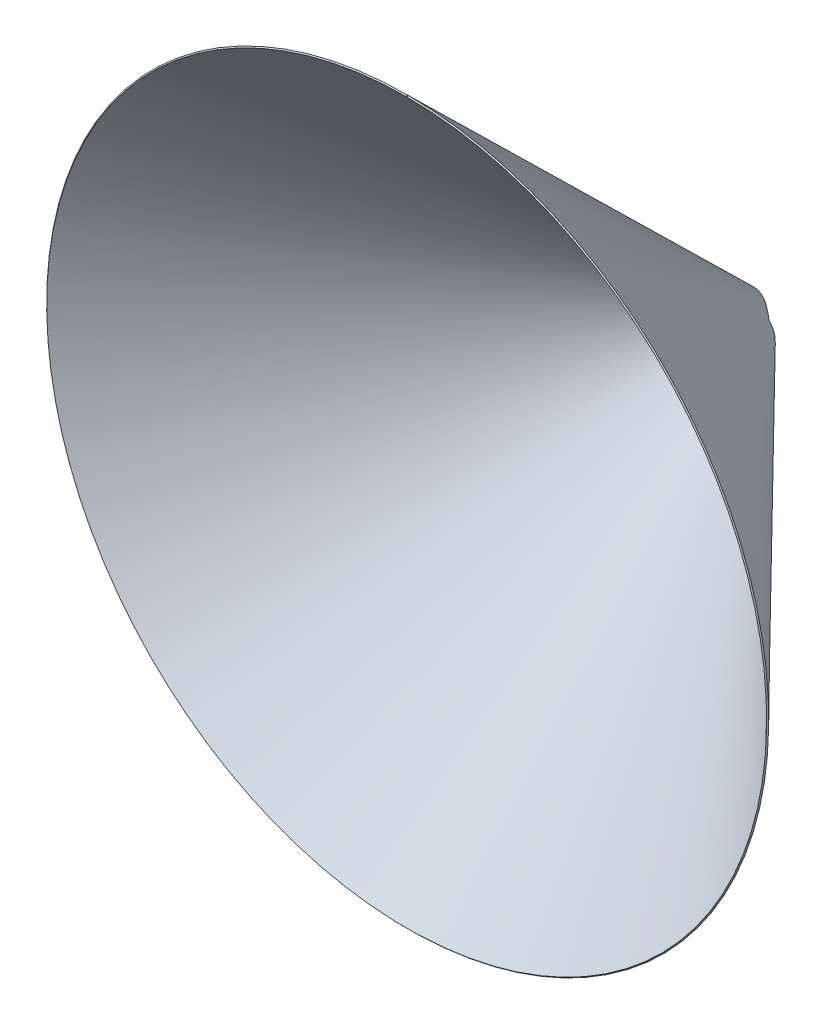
ISO-10303-21;
HEADER;
FILE_DESCRIPTION(('STEP AP214'),'2;1');
FILE_NAME('part.step','',(''),(''),'','','');
FILE_SCHEMA(('AUTOMOTIVE_DESIGN { 1 0 10303 214 1 1 1 1 }'));
ENDSEC;
DATA;
#1=APPLICATION_CONTEXT('core data for automotive mechanical design processes');
#2=APPLICATION_PROTOCOL_DEFINITION('international standard','automotive_design',2000,#1);
#3=PRODUCT_CONTEXT('',#1,'mechanical');
#4=PRODUCT('Part','Part','',(#3));
#5=PRODUCT_RELATED_PRODUCT_CATEGORY('part','',(#4));
#6=PRODUCT_DEFINITION_FORMATION('','',#4);
#7=PRODUCT_DEFINITION_CONTEXT('part definition',#1,'design');
#8=PRODUCT_DEFINITION('design','',#6,#7);
#9=PRODUCT_DEFINITION_SHAPE('','',#8);
#10=(LENGTH_UNIT() NAMED_UNIT(*) SI_UNIT(.MILLI.,.METRE.));
#11=(NAMED_UNIT(*) PLANE_ANGLE_UNIT() SI_UNIT($,.RADIAN.));
#12=(NAMED_UNIT(*) SI_UNIT($,.STERADIAN.) SOLID_ANGLE_UNIT());
#13=UNCERTAINTY_MEASURE_WITH_UNIT(LENGTH_MEASURE(1.E-05),#10,'distance_accuracy_value','');
#14=(GEOMETRIC_REPRESENTATION_CONTEXT(3) GLOBAL_UNCERTAINTY_ASSIGNED_CONTEXT((#13)) GLOBAL_UNIT_ASSIGNED_CONTEXT((#10,
#11,#12)) REPRESENTATION_CONTEXT('',''));
#15=CARTESIAN_POINT('',(0.,0.,0.));
#16=DIRECTION('',(0.,0.,1.));
#17=DIRECTION('',(1.,0.,0.));
#18=AXIS2_PLACEMENT_3D('',#15,#16,#17);
#19=CARTESIAN_POINT('',(-0.0043633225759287,4.99999809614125,0.));
#20=DIRECTION('',(-0.999999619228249,-0.000872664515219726,0.));
#21=DIRECTION('',(-0.00061080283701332,0.699928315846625,0.714212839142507));
#22=AXIS2_PLACEMENT_3D('',#19,#20,#21);
#23=PLANE('',#22);
#24=DIRECTION('',(-0.000610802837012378,0.699928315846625,0.714212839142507));
#25=VECTOR('',#24,1.);
#26=CARTESIAN_POINT('',(-0.00374005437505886,4.28578552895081,0.699928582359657));
#27=LINE('',#26,#25);
#28=CARTESIAN_POINT('',(-0.0130899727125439,15.,11.6328046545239));
#29=VERTEX_POINT('',#28);
#30=CARTESIAN_POINT('',(-0.217542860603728,249.285692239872,250.69992858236));
#31=VERTEX_POINT('',#30);
#32=EDGE_CURVE('E70',#29,#31,#27,.T.);
#33=ORIENTED_EDGE('',*,*,#32,.F.);
#34=DIRECTION('',(-0.000623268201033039,0.714212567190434,-0.699928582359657));
#35=VECTOR('',#34,1.);
#36=CARTESIAN_POINT('',(-0.0130899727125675,15.,11.6328046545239));
#37=LINE('',#36,#35);
#38=CARTESIAN_POINT('',(-0.0137132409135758,15.7142125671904,10.9328760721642));
#39=VERTEX_POINT('',#38);
#40=EDGE_CURVE('E234',#29,#39,#37,.T.);
#41=ORIENTED_EDGE('',*,*,#40,.T.);
#42=DIRECTION('',(-0.00061080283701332,0.699928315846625,0.714212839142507));
#43=VECTOR('',#42,1.);
#44=CARTESIAN_POINT('',(-0.0043633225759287,4.99999809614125,0.));
#45=LINE('',#44,#43);
#46=CARTESIAN_POINT('',(-0.218166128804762,249.999904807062,250.));
#47=VERTEX_POINT('',#46);
#48=EDGE_CURVE('E241',#39,#47,#45,.T.);
#49=ORIENTED_EDGE('',*,*,#48,.T.);
#50=DIRECTION('',(0.000623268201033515,-0.714212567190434,0.699928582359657));
#51=VECTOR('',#50,1.);
#52=CARTESIAN_POINT('',(-0.218166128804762,249.999904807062,250.));
#53=LINE('',#52,#51);
#54=EDGE_CURVE('E12',#47,#31,#53,.T.);
#55=ORIENTED_EDGE('',*,*,#54,.T.);
#56=EDGE_LOOP('',(#33,#41,#49,#55));
#57=FACE_BOUND('',#56,.T.);
#58=ADVANCED_FACE('F47',(#57),#23,.F.);
#59=CARTESIAN_POINT('',(0.00436332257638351,4.99999809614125,0.));
#60=DIRECTION('',(-0.999999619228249,0.000872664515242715,0.));
#61=DIRECTION('',(0.000610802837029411,0.699928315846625,0.714212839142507));
#62=AXIS2_PLACEMENT_3D('',#59,#60,#61);
#63=PLANE('',#62);
#64=DIRECTION('',(0.000610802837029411,0.699928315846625,0.714212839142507));
#65=VECTOR('',#64,1.);
#66=CARTESIAN_POINT('',(0.00436332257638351,4.99999809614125,0.));
#67=LINE('',#66,#65);
#68=CARTESIAN_POINT('',(0.0137132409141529,15.7142125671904,10.9328760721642));
#69=VERTEX_POINT('',#68);
#70=CARTESIAN_POINT('',(0.218166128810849,249.999904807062,250.));
#71=VERTEX_POINT('',#70);
#72=EDGE_CURVE('E83',#69,#71,#67,.T.);
#73=ORIENTED_EDGE('',*,*,#72,.F.);
#74=DIRECTION('',(0.000623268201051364,0.714212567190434,-0.699928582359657));
#75=VECTOR('',#74,1.);
#76=CARTESIAN_POINT('',(0.0130899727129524,15.,11.6328046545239));
#77=LINE('',#76,#75);
#78=CARTESIAN_POINT('',(0.0130899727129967,15.,11.6328046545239));
#79=VERTEX_POINT('',#78);
#80=EDGE_CURVE('E61',#79,#69,#77,.T.);
#81=ORIENTED_EDGE('',*,*,#80,.F.);
#82=DIRECTION('',(0.000610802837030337,0.699928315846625,0.714212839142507));
#83=VECTOR('',#82,1.);
#84=CARTESIAN_POINT('',(0.00374005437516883,4.28578552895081,0.699928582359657));
#85=LINE('',#84,#83);
#86=CARTESIAN_POINT('',(0.217542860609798,249.285692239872,250.69992858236));
#87=VERTEX_POINT('',#86);
#88=EDGE_CURVE('E135',#79,#87,#85,.T.);
#89=ORIENTED_EDGE('',*,*,#88,.T.);
#90=DIRECTION('',(-0.000623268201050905,-0.714212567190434,0.699928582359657));
#91=VECTOR('',#90,1.);
#92=CARTESIAN_POINT('',(0.218166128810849,249.999904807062,250.));
#93=LINE('',#92,#91);
#94=EDGE_CURVE('E54',#71,#87,#93,.T.);
#95=ORIENTED_EDGE('',*,*,#94,.F.);
#96=EDGE_LOOP('',(#73,#81,#89,#95));
#97=FACE_BOUND('',#96,.T.);
#98=ADVANCED_FACE('F254',(#97),#63,.T.);
#99=CARTESIAN_POINT('',(0.,0.,0.699928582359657));
#100=DIRECTION('',(0.,0.,1.));
#101=DIRECTION('',(1.,0.,0.));
#102=AXIS2_PLACEMENT_3D('',#99,#100,#101);
#103=CONICAL_SURFACE('',#102,4.28578716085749,0.775297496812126);
#104=CARTESIAN_POINT('',(-25.,15.,26.0764309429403));
#105=CARTESIAN_POINT('',(-24.9999955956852,14.7018759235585,25.9199194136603));
#106=CARTESIAN_POINT('',(-24.9999839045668,14.4023554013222,25.7660865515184));
#107=CARTESIAN_POINT('',(-24.9999628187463,13.7998631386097,25.4640259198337));
#108=CARTESIAN_POINT('',(-24.9999534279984,13.4968863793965,25.3158081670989));
#109=CARTESIAN_POINT('',(-24.9999542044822,12.5794154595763,24.8788828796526));
#110=CARTESIAN_POINT('',(-24.9999938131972,11.9602027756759,24.5999256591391));
#111=CARTESIAN_POINT('',(-25.0000026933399,11.0217142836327,24.2045038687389));
#112=CARTESIAN_POINT('',(-24.9999972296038,10.7072562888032,24.0765261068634));
#113=CARTESIAN_POINT('',(-24.9999955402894,10.0749990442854,23.8289033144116));
#114=CARTESIAN_POINT('',(-24.9999993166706,9.75719910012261,23.70926005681));
#115=CARTESIAN_POINT('',(-25.0000038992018,8.79905888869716,23.3639614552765));
#116=CARTESIAN_POINT('',(-24.9999979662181,8.15375585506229,23.1518426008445));
#117=CARTESIAN_POINT('',(-25.0000030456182,6.85086137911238,22.7697351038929));
#118=CARTESIAN_POINT('',(-25.0000140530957,6.19327354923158,22.5997342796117));
#119=CARTESIAN_POINT('',(-25.0000079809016,5.08392900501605,22.3552164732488));
#120=CARTESIAN_POINT('',(-24.9999988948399,4.63503218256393,22.2676439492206));
#121=CARTESIAN_POINT('',(-25.000002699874,3.7332676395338,22.1157593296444));
#122=CARTESIAN_POINT('',(-25.000015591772,3.28039977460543,22.0514480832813));
#123=CARTESIAN_POINT('',(-25.0000351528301,2.37187552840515,21.9473315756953));
#124=CARTESIAN_POINT('',(-25.0000418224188,1.91621934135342,21.9075246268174));
#125=CARTESIAN_POINT('',(-25.0000282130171,1.00388871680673,21.8532440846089));
#126=CARTESIAN_POINT('',(-25.0000079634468,0.547215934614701,21.8387428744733));
#127=CARTESIAN_POINT('',(-24.9999927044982,-0.366258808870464,21.8353528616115));
#128=CARTESIAN_POINT('',(-24.9999976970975,-0.823060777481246,21.8464660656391));
#129=CARTESIAN_POINT('',(-25.0000025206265,-1.73531400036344,21.8940400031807));
#130=CARTESIAN_POINT('',(-25.0000023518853,-2.19076533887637,21.9304991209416));
#131=CARTESIAN_POINT('',(-25.0000008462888,-2.99790504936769,22.0171446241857));
#132=CARTESIAN_POINT('',(-24.999999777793,-3.35012501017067,22.0624693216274));
#133=CARTESIAN_POINT('',(-25.0000008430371,-4.0524366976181,22.1674237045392));
#134=CARTESIAN_POINT('',(-25.0000029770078,-4.40252826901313,22.2270544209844));
#135=CARTESIAN_POINT('',(-25.0000065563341,-5.44889853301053,22.4264291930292));
#136=CARTESIAN_POINT('',(-25.000005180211,-6.14135186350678,22.5866646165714));
#137=CARTESIAN_POINT('',(-25.0000019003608,-7.51502863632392,22.9559053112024));
#138=CARTESIAN_POINT('',(-24.9999999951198,-8.19621382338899,23.1650502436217));
#139=CARTESIAN_POINT('',(-24.9999990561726,-9.54422568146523,23.625000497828));
#140=CARTESIAN_POINT('',(-25.0000000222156,-10.2110536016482,23.8758021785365));
#141=CARTESIAN_POINT('',(-25.0000003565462,-11.2237742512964,24.2878756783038));
#142=CARTESIAN_POINT('',(-25.0000002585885,-11.5748532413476,24.4366147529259));
#143=CARTESIAN_POINT('',(-24.9999796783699,-12.2729393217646,24.7432537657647));
#144=CARTESIAN_POINT('',(-24.9999591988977,-12.6199469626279,24.9011524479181));
#145=CARTESIAN_POINT('',(-24.9999473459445,-13.3079374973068,25.2243369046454));
#146=CARTESIAN_POINT('',(-24.9999557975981,-13.6489441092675,25.3895723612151));
#147=CARTESIAN_POINT('',(-24.9999788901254,-14.3272306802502,25.7275567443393));
#148=CARTESIAN_POINT('',(-24.9999935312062,-14.6645105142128,25.9003059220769));
#149=CARTESIAN_POINT('',(-25.,-15.,26.0764309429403));
#150=B_SPLINE_CURVE_WITH_KNOTS('',3,(#104,#105,#106,#107,#108,#109,#110,#111,#112,#113,#114,
#115,#116,#117,#118,#119,#120,#121,#122,#123,#124,#125,#126,#127,#128,#129,#130,#131,#132,#133,
#134,#135,#136,#137,#138,#139,#140,#141,#142,#143,#144,#145,#146,#147,#148,#149),.UNSPECIFIED.,
.F.,.F.,(4,2,2,2,2,2,2,2,2,2,2,2,2,2,2,2,2,2,2,2,2,2,4),(0.,1.01009431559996,2.02191297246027,
4.05851394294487,5.07692236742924,6.09554677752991,8.13207147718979,10.1680064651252,
11.5395420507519,12.911127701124,14.2826188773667,15.6526123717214,17.0227132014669,
18.3927266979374,19.4578016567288,20.5229533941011,22.6530188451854,24.7892426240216,
26.9252797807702,28.0690334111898,29.2126305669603,30.3493278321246,31.4860631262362),.UNSPECIFIED.);
#151=CARTESIAN_POINT('',(-25.,15.,26.0764309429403));
#152=VERTEX_POINT('',#151);
#153=CARTESIAN_POINT('',(-25.,-15.,26.0764309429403));
#154=VERTEX_POINT('',#153);
#155=EDGE_CURVE('E138',#152,#154,#150,.T.);
#156=ORIENTED_EDGE('',*,*,#155,.F.);
#157=CARTESIAN_POINT('',(-0.0130899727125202,15.,11.6328046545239));
#158=CARTESIAN_POINT('',(-0.182528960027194,15.0000012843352,11.6329486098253));
#159=CARTESIAN_POINT('',(-0.351962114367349,15.0000140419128,11.6360500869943));
#160=CARTESIAN_POINT('',(-0.690593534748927,15.000047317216,11.6480896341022));
#161=CARTESIAN_POINT('',(-0.85979183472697,15.0000678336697,11.6570267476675));
#162=CARTESIAN_POINT('',(-1.1972482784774,15.0001013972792,11.6806216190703));
#163=CARTESIAN_POINT('',(-1.36550770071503,15.0001144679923,11.6952610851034));
#164=CARTESIAN_POINT('',(-1.70146416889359,15.000128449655,11.7301387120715));
#165=CARTESIAN_POINT('',(-1.86916112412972,15.0001293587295,11.7503777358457));
#166=CARTESIAN_POINT('',(-2.3721179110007,15.0001093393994,11.819407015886));
#167=CARTESIAN_POINT('',(-2.70627865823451,15.0000655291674,11.8764406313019));
#168=CARTESIAN_POINT('',(-3.37065743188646,15.0000116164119,12.0109672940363));
#169=CARTESIAN_POINT('',(-3.70087227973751,15.0000015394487,12.0884758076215));
#170=CARTESIAN_POINT('',(-4.35644646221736,14.9999986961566,12.2619870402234));
#171=CARTESIAN_POINT('',(-4.68180484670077,15.0000059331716,12.3579933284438));
#172=CARTESIAN_POINT('',(-5.32878988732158,15.0000025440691,12.5669273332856));
#173=CARTESIAN_POINT('',(-5.65039002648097,14.9999918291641,12.6799366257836));
#174=CARTESIAN_POINT('',(-6.28798672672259,14.9999917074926,12.9204956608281));
#175=CARTESIAN_POINT('',(-6.60398463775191,15.0000022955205,13.0480418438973));
#176=CARTESIAN_POINT('',(-7.23054601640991,14.9999920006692,13.3157713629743));
#177=CARTESIAN_POINT('',(-7.54110956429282,14.9999711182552,13.4559545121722));
#178=CARTESIAN_POINT('',(-8.24485280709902,14.999909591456,13.7888342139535));
#179=CARTESIAN_POINT('',(-8.63633903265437,14.9998650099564,13.9851067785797));
#180=CARTESIAN_POINT('',(-9.41140826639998,14.9998911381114,14.3928297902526));
#181=CARTESIAN_POINT('',(-9.79498909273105,14.9999618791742,14.6042843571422));
#182=CARTESIAN_POINT('',(-10.555139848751,15.0000165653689,15.0397644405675));
#183=CARTESIAN_POINT('',(-10.9317066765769,15.0000004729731,15.2637953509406));
#184=CARTESIAN_POINT('',(-11.6783888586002,14.9999897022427,15.7223663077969));
#185=CARTESIAN_POINT('',(-12.0485039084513,14.9999950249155,15.9569068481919));
#186=CARTESIAN_POINT('',(-12.7834886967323,15.0000044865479,16.4351256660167));
#187=CARTESIAN_POINT('',(-13.1483505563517,15.0000086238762,16.6788160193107));
#188=CARTESIAN_POINT('',(-13.8728383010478,14.9999913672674,17.1735671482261));
#189=CARTESIAN_POINT('',(-14.2324660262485,14.9999699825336,17.4246252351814));
#190=CARTESIAN_POINT('',(-14.9471369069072,14.9999531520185,17.9330787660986));
#191=CARTESIAN_POINT('',(-15.3021806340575,14.9999577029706,18.1904734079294));
#192=CARTESIAN_POINT('',(-16.0082347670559,14.9999801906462,18.7107046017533));
#193=CARTESIAN_POINT('',(-16.3592453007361,14.9999981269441,18.9735409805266));
#194=CARTESIAN_POINT('',(-17.0667031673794,14.9999994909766,19.5107245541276));
#195=CARTESIAN_POINT('',(-17.4230576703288,14.9999820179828,19.785193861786));
#196=CARTESIAN_POINT('',(-18.1324339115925,14.9999744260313,20.3384236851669));
#197=CARTESIAN_POINT('',(-18.4854555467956,14.9999843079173,20.6171843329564));
#198=CARTESIAN_POINT('',(-19.1885553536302,14.9999977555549,21.1784367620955));
#199=CARTESIAN_POINT('',(-19.5386333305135,15.0000013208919,21.4609287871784));
#200=CARTESIAN_POINT('',(-20.2361695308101,14.9999686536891,22.0291662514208));
#201=CARTESIAN_POINT('',(-20.5836276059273,14.9999324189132,22.3149118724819));
#202=CARTESIAN_POINT('',(-21.2732165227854,14.9998794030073,22.8868270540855));
#203=CARTESIAN_POINT('',(-21.6153675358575,14.9998624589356,23.1729723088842));
#204=CARTESIAN_POINT('',(-22.297547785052,14.9998549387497,23.7477470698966));
#205=CARTESIAN_POINT('',(-22.6375771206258,14.9998643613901,24.0363764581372));
#206=CARTESIAN_POINT('',(-23.3156945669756,14.9999020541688,24.6158119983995));
#207=CARTESIAN_POINT('',(-23.6537829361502,14.9999303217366,24.906617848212));
#208=CARTESIAN_POINT('',(-24.3281682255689,14.9999783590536,25.4901367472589));
#209=CARTESIAN_POINT('',(-24.6644655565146,14.9999981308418,25.7828493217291));
#210=CARTESIAN_POINT('',(-25.,15.,26.0764309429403));
#211=B_SPLINE_CURVE_WITH_KNOTS('',3,(#157,#158,#159,#160,#161,#162,#163,#164,#165,#166,#167,
#168,#169,#170,#171,#172,#173,#174,#175,#176,#177,#178,#179,#180,#181,#182,#183,#184,#185,#186,
#187,#188,#189,#190,#191,#192,#193,#194,#195,#196,#197,#198,#199,#200,#201,#202,#203,#204,#205,
#206,#207,#208,#209,#210),.UNSPECIFIED.,.F.,.F.,(4,2,2,2,2,2,2,2,2,2,2,2,2,2,2,2,2,2,2,2,2,2,2,
2,2,2,4),(0.,0.508286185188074,1.01648909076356,1.52307505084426,2.0297391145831,
3.04596394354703,4.06295861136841,5.08014970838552,6.10238655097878,7.12437362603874,
8.14634559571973,9.45972616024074,10.7734644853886,12.0877706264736,13.4021385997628,
14.7183068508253,16.0340006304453,17.3495287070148,18.6650149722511,20.0143839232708,
21.3637944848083,22.713293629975,24.0628685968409,25.4009575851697,26.7389833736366,
28.0768266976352,29.4143487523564),.UNSPECIFIED.);
#212=EDGE_CURVE('E136',#29,#152,#211,.T.);
#213=ORIENTED_EDGE('',*,*,#212,.F.);
#214=ORIENTED_EDGE('',*,*,#32,.T.);
#215=CARTESIAN_POINT('',(0.,0.,250.69992858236));
#216=DIRECTION('',(0.,0.,1.));
#217=DIRECTION('',(1.,0.,0.));
#218=AXIS2_PLACEMENT_3D('',#215,#216,#217);
#219=CIRCLE('',#218,249.285787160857);
#220=EDGE_CURVE('E249',#31,#87,#219,.T.);
#221=ORIENTED_EDGE('',*,*,#220,.T.);
#222=ORIENTED_EDGE('',*,*,#88,.F.);
#223=CARTESIAN_POINT('',(25.,15.,26.0764309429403));
#224=CARTESIAN_POINT('',(24.7464301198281,14.9999993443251,25.854560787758));
#225=CARTESIAN_POINT('',(24.4924225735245,14.9999875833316,25.6331910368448));
#226=CARTESIAN_POINT('',(23.9833698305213,14.999954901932,25.1914733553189));
#227=CARTESIAN_POINT('',(23.728324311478,14.9999339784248,24.9711257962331));
#228=CARTESIAN_POINT('',(22.9613642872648,14.9998770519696,24.3116313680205));
#229=CARTESIAN_POINT('',(22.4479050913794,14.9998469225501,23.8742770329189));
#230=CARTESIAN_POINT('',(21.4161580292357,14.9998666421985,23.0052864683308));
#231=CARTESIAN_POINT('',(20.8978701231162,14.9999164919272,22.5736502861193));
#232=CARTESIAN_POINT('',(19.8560048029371,14.9999781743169,21.7175178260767));
#233=CARTESIAN_POINT('',(19.3324311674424,14.9999900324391,21.2930169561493));
#234=CARTESIAN_POINT('',(18.2786118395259,14.9999921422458,20.4523569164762));
#235=CARTESIAN_POINT('',(17.7483661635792,14.9999823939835,20.0361977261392));
#236=CARTESIAN_POINT('',(16.8579376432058,14.9999906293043,19.3511898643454));
#237=CARTESIAN_POINT('',(16.4999668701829,15.0000004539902,19.0794658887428));
#238=CARTESIAN_POINT('',(15.7800373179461,14.999986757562,18.541341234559));
#239=CARTESIAN_POINT('',(15.4180785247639,14.9999632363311,18.274940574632));
#240=CARTESIAN_POINT('',(14.6896147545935,14.999961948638,17.7483845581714));
#241=CARTESIAN_POINT('',(14.3231095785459,14.9999841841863,17.488229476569));
#242=CARTESIAN_POINT('',(13.5836683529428,14.9999962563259,16.9743113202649));
#243=CARTESIAN_POINT('',(13.2107138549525,14.999985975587,16.7205747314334));
#244=CARTESIAN_POINT('',(12.4589997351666,14.9999464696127,16.2218488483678));
#245=CARTESIAN_POINT('',(12.0802402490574,14.9999172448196,15.9768593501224));
#246=CARTESIAN_POINT('',(11.3161049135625,14.9999444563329,15.4973673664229));
#247=CARTESIAN_POINT('',(10.9307289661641,15.0000008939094,15.262865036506));
#248=CARTESIAN_POINT('',(10.2455940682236,14.9999966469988,14.8608800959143));
#249=CARTESIAN_POINT('',(9.94737709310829,14.9999607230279,14.6907708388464));
#250=CARTESIAN_POINT('',(9.34629177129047,14.999888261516,14.3589347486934));
#251=CARTESIAN_POINT('',(9.04342333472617,14.9998517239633,14.1972080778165));
#252=CARTESIAN_POINT('',(8.4325194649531,14.9998624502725,13.883438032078));
#253=CARTESIAN_POINT('',(8.12448171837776,14.9999097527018,13.7313991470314));
#254=CARTESIAN_POINT('',(7.50311085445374,14.999974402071,13.4385278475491));
#255=CARTESIAN_POINT('',(7.18977783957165,14.99999174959,13.2976952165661));
#256=CARTESIAN_POINT('',(6.56011170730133,15.0000068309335,13.0300448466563));
#257=CARTESIAN_POINT('',(6.24382257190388,15.0000047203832,12.9031241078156));
#258=CARTESIAN_POINT('',(5.60570348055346,15.0000012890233,12.6639147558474));
#259=CARTESIAN_POINT('',(5.28387315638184,14.9999999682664,12.5516271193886));
#260=CARTESIAN_POINT('',(4.63523070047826,14.9999987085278,12.3438551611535));
#261=CARTESIAN_POINT('',(4.30842502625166,14.9999987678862,12.2483507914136));
#262=CARTESIAN_POINT('',(3.64996459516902,15.000000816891,12.0760770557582));
#263=CARTESIAN_POINT('',(3.31831129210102,15.00000280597,11.99930219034));
#264=CARTESIAN_POINT('',(2.74099861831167,15.000003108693,11.8843389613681));
#265=CARTESIAN_POINT('',(2.49629404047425,15.0000022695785,11.841328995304));
#266=CARTESIAN_POINT('',(2.00514385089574,15.0000010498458,11.7669617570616));
#267=CARTESIAN_POINT('',(1.75869848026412,15.0000006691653,11.7356029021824));
#268=CARTESIAN_POINT('',(1.26276242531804,15.0000001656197,11.6848627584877));
#269=CARTESIAN_POINT('',(1.01326260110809,15.0000000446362,11.6655695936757));
#270=CARTESIAN_POINT('',(0.638502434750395,15.0000060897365,11.6461358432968));
#271=CARTESIAN_POINT('',(0.513473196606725,15.0000091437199,11.6412422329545));
#272=CARTESIAN_POINT('',(0.263328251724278,15.0000101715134,11.6346356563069));
#273=CARTESIAN_POINT('',(0.138212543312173,15.0000081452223,11.6329227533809));
#274=CARTESIAN_POINT('',(0.0130899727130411,15.,11.6328046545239));
#275=B_SPLINE_CURVE_WITH_KNOTS('',3,(#223,#224,#225,#226,#227,#228,#229,#230,#231,#232,#233,
#234,#235,#236,#237,#238,#239,#240,#241,#242,#243,#244,#245,#246,#247,#248,#249,#250,#251,#252,
#253,#254,#255,#256,#257,#258,#259,#260,#261,#262,#263,#264,#265,#266,#267,#268,#269,#270,#271,
#272,#273,#274),.UNSPECIFIED.,.F.,.F.,(4,2,2,2,2,2,2,2,2,2,2,2,2,2,2,2,2,2,2,2,2,2,2,2,2,4),(0.,
1.01079868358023,2.02193976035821,4.04533386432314,6.06874468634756,8.09079916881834,
10.1128486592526,11.4610636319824,12.8092833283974,14.157562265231,15.5107118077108,
16.8638297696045,18.2169677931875,19.2468241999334,20.276700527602,21.3070507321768,
22.3373810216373,23.3594779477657,24.3816430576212,25.402578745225,26.4232142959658,
27.1683261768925,27.9133368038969,28.6637270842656,29.0390667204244,29.4144138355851),.UNSPECIFIED.);
#276=CARTESIAN_POINT('',(25.,15.,26.0764309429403));
#277=VERTEX_POINT('',#276);
#278=EDGE_CURVE('E126',#277,#79,#275,.T.);
#279=ORIENTED_EDGE('',*,*,#278,.F.);
#280=CARTESIAN_POINT('',(25.,-15.,26.0764309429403));
#281=CARTESIAN_POINT('',(24.999995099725,-14.7018761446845,25.9199190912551));
#282=CARTESIAN_POINT('',(24.9999828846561,-14.4023558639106,25.766085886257));
#283=CARTESIAN_POINT('',(24.9999608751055,-13.7998639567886,25.4640245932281));
#284=CARTESIAN_POINT('',(24.9999510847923,-13.4968873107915,25.3158065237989));
#285=CARTESIAN_POINT('',(24.9999511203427,-12.5794163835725,24.8788804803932));
#286=CARTESIAN_POINT('',(24.9999908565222,-11.9602033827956,24.5999231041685));
#287=CARTESIAN_POINT('',(25.0000045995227,-11.0217130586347,24.2045051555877));
#288=CARTESIAN_POINT('',(25.0000015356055,-10.7072542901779,24.0765293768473));
#289=CARTESIAN_POINT('',(24.9999991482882,-10.0749972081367,23.8289059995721));
#290=CARTESIAN_POINT('',(24.999999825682,-9.75719820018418,23.7092601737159));
#291=CARTESIAN_POINT('',(25.0000001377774,-8.79905945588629,23.3639581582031));
#292=CARTESIAN_POINT('',(24.9999980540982,-8.15375546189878,23.1518426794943));
#293=CARTESIAN_POINT('',(25.0000026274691,-6.85086130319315,22.7697345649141));
#294=CARTESIAN_POINT('',(25.0000092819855,-6.19327475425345,22.599729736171));
#295=CARTESIAN_POINT('',(25.0000067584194,-5.08392939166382,22.3552153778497));
#296=CARTESIAN_POINT('',(25.0000020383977,-4.63503114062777,22.2676469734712));
#297=CARTESIAN_POINT('',(24.9999991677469,-3.73326636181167,22.1157555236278));
#298=CARTESIAN_POINT('',(25.0000010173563,-3.28039969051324,22.0514333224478));
#299=CARTESIAN_POINT('',(25.0000025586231,-2.37187708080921,21.94729867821));
#300=CARTESIAN_POINT('',(25.0000022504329,-1.91622134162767,21.9074845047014));
#301=CARTESIAN_POINT('',(24.999998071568,-1.00389043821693,21.8532134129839));
#302=CARTESIAN_POINT('',(24.9999942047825,-0.547216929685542,21.8387288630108));
#303=CARTESIAN_POINT('',(25.0000063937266,0.366259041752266,21.8353668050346));
#304=CARTESIAN_POINT('',(25.0000224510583,0.823061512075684,21.8464913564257));
#305=CARTESIAN_POINT('',(25.0000396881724,1.73531587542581,21.8940779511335));
#306=CARTESIAN_POINT('',(25.0000408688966,2.19076785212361,21.9305383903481));
#307=CARTESIAN_POINT('',(25.0000220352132,2.9979429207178,22.01717025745));
#308=CARTESIAN_POINT('',(25.0000066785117,3.35019680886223,22.0624856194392));
#309=CARTESIAN_POINT('',(24.9999968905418,4.05257347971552,22.1674415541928));
#310=CARTESIAN_POINT('',(25.0000024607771,4.40269610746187,22.2270831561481));
#311=CARTESIAN_POINT('',(25.0000114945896,5.44915815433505,22.4264890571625));
#312=CARTESIAN_POINT('',(25.0000072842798,6.14167207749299,22.5867433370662));
#313=CARTESIAN_POINT('',(25.0000027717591,7.5154662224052,22.9560332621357));
#314=CARTESIAN_POINT('',(25.0000024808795,8.19670818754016,23.1652085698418));
#315=CARTESIAN_POINT('',(24.9999990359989,9.54483303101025,23.6252204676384));
#316=CARTESIAN_POINT('',(24.999995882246,10.2117171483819,23.876053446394));
#317=CARTESIAN_POINT('',(24.9999976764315,11.2244281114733,24.2881471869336));
#318=CARTESIAN_POINT('',(24.9999995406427,11.5754443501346,24.4368682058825));
#319=CARTESIAN_POINT('',(24.9999814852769,12.2734067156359,24.7434663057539));
#320=CARTESIAN_POINT('',(24.9999615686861,12.6203533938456,24.9013421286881));
#321=CARTESIAN_POINT('',(24.999949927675,13.3082245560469,25.2244774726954));
#322=CARTESIAN_POINT('',(24.9999580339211,13.6491727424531,25.3896867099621));
#323=CARTESIAN_POINT('',(24.9999801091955,14.3273439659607,25.7276158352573));
#324=CARTESIAN_POINT('',(24.9999940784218,14.6645668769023,25.9003359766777));
#325=CARTESIAN_POINT('',(25.,15.,26.0764309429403));
#326=B_SPLINE_CURVE_WITH_KNOTS('',3,(#280,#281,#282,#283,#284,#285,#286,#287,#288,#289,#290,
#291,#292,#293,#294,#295,#296,#297,#298,#299,#300,#301,#302,#303,#304,#305,#306,#307,#308,#309,
#310,#311,#312,#313,#314,#315,#316,#317,#318,#319,#320,#321,#322,#323,#324,#325),.UNSPECIFIED.,
.F.,.F.,(4,2,2,2,2,2,2,2,2,2,2,2,2,2,2,2,2,2,2,2,2,2,4),(0.,1.01009415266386,2.02191293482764,
4.05851468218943,5.07692309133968,6.09554756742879,8.13207190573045,10.16800589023,
11.5395434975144,12.911130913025,14.2826214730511,15.6526149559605,17.0227186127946,
18.3927355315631,19.457907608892,20.5231562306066,22.6534116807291,24.7898245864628,
26.9260523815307,28.0696115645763,29.2130139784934,30.3495192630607,31.4860629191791),.UNSPECIFIED.);
#327=CARTESIAN_POINT('',(25.,-15.,26.0764309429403));
#328=VERTEX_POINT('',#327);
#329=EDGE_CURVE('E119',#328,#277,#326,.T.);
#330=ORIENTED_EDGE('',*,*,#329,.F.);
#331=CARTESIAN_POINT('',(-25.,-15.,26.0764309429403));
#332=CARTESIAN_POINT('',(-24.7461285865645,-14.9999996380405,25.8542972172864));
#333=CARTESIAN_POINT('',(-24.4918185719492,-14.9999877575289,25.6326648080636));
#334=CARTESIAN_POINT('',(-23.9823606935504,-14.9999549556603,25.1906000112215));
#335=CARTESIAN_POINT('',(-23.7272132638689,-14.9999340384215,24.9701671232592));
#336=CARTESIAN_POINT('',(-22.9602744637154,-14.9998786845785,24.3107019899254));
#337=CARTESIAN_POINT('',(-22.4469392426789,-14.9998516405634,23.8734617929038));
#338=CARTESIAN_POINT('',(-21.4154405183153,-14.9998664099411,23.0046864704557));
#339=CARTESIAN_POINT('',(-20.8972769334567,-14.9999082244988,22.5731514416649));
#340=CARTESIAN_POINT('',(-20.1154258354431,-14.9999707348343,21.9306999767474));
#341=CARTESIAN_POINT('',(-19.8538536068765,-14.9999915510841,21.7172079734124));
#342=CARTESIAN_POINT('',(-19.3291745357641,-15.0000038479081,21.2921185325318));
#343=CARTESIAN_POINT('',(-19.0660676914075,-14.9999953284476,21.0805210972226));
#344=CARTESIAN_POINT('',(-18.2742497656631,-14.9999799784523,20.4488969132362));
#345=CARTESIAN_POINT('',(-17.7430157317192,-14.9999833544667,20.0320172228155));
#346=CARTESIAN_POINT('',(-16.8180096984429,-14.9999916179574,19.3205215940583));
#347=CARTESIAN_POINT('',(-16.426113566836,-14.9999958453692,19.0234666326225));
#348=CARTESIAN_POINT('',(-15.6374752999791,-14.9999762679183,18.4358221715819));
#349=CARTESIAN_POINT('',(-15.2407330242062,-14.9999524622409,18.1452328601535));
#350=CARTESIAN_POINT('',(-14.4416117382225,-14.9999584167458,17.5717169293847));
#351=CARTESIAN_POINT('',(-14.0392315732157,-14.9999881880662,17.2887919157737));
#352=CARTESIAN_POINT('',(-13.2279121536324,-15.0000107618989,16.7319765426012));
#353=CARTESIAN_POINT('',(-12.8189692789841,-15.0000035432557,16.458091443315));
#354=CARTESIAN_POINT('',(-11.9943227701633,-14.9999959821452,15.9217763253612));
#355=CARTESIAN_POINT('',(-11.5786279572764,-14.9999956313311,15.6593327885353));
#356=CARTESIAN_POINT('',(-10.7390210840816,-14.9999944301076,15.1479648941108));
#357=CARTESIAN_POINT('',(-10.3151097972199,-14.9999935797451,14.8990392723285));
#358=CARTESIAN_POINT('',(-9.45829232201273,-14.9999280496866,14.4178319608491));
#359=CARTESIAN_POINT('',(-9.02539265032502,-14.9998634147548,14.1855387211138));
#360=CARTESIAN_POINT('',(-8.14935622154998,-14.9998910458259,13.7414404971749));
#361=CARTESIAN_POINT('',(-7.70622438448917,-14.9999832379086,13.5296259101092));
#362=CARTESIAN_POINT('',(-7.03538951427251,-15.0000060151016,13.2315147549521));
#363=CARTESIAN_POINT('',(-6.81184382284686,-14.9999946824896,13.1358264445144));
#364=CARTESIAN_POINT('',(-6.36196577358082,-14.9999867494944,12.951245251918));
#365=CARTESIAN_POINT('',(-6.13563341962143,-14.9999901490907,12.8623523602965));
#366=CARTESIAN_POINT('',(-5.45243303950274,-14.9999984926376,12.6068842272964));
#367=CARTESIAN_POINT('',(-4.99129882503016,-15.0000015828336,12.4514911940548));
#368=CARTESIAN_POINT('',(-4.06027612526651,-14.9999984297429,12.1771455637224));
#369=CARTESIAN_POINT('',(-3.59043374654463,-14.9999922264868,12.0580393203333));
#370=CARTESIAN_POINT('',(-2.87927504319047,-15.0000511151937,11.9104762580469));
#371=CARTESIAN_POINT('',(-2.64113268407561,-15.0000821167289,11.8664685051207));
#372=CARTESIAN_POINT('',(-2.16309925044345,-15.0001227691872,11.7893787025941));
#373=CARTESIAN_POINT('',(-1.92320831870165,-15.0001324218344,11.7562957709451));
#374=CARTESIAN_POINT('',(-1.35776240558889,-15.0001209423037,11.6919714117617));
#375=CARTESIAN_POINT('',(-1.03165068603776,-15.0000878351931,11.6654390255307));
#376=CARTESIAN_POINT('',(-0.541739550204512,-15.0000321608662,11.6419038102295));
#377=CARTESIAN_POINT('',(-0.378291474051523,-15.0000125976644,11.6367696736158));
#378=CARTESIAN_POINT('',(-0.0513122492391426,-14.9999992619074,11.6319786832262));
#379=CARTESIAN_POINT('',(0.112218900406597,-15.000005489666,11.6323218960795));
#380=CARTESIAN_POINT('',(0.60258677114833,-15.0000131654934,11.6415314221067));
#381=CARTESIAN_POINT('',(0.929305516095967,-15.0000036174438,11.6585724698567));
#382=CARTESIAN_POINT('',(1.58161232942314,-14.9999971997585,11.7140618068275));
#383=CARTESIAN_POINT('',(1.90719625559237,-15.0000003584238,11.7525577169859));
#384=CARTESIAN_POINT('',(2.55535195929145,-15.0000030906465,11.8498695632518));
#385=CARTESIAN_POINT('',(2.87792321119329,-15.0000026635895,11.9086889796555));
#386=CARTESIAN_POINT('',(3.51905911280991,-15.0000010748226,12.0451183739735));
#387=CARTESIAN_POINT('',(3.83762347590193,-14.9999999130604,12.1227296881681));
#388=CARTESIAN_POINT('',(4.47705282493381,-14.9999991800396,12.2968607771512));
#389=CARTESIAN_POINT('',(4.79781408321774,-14.9999996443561,12.3937591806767));
#390=CARTESIAN_POINT('',(5.43416614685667,-14.9999996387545,12.6033675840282));
#391=CARTESIAN_POINT('',(5.74975591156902,-14.9999991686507,12.7160807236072));
#392=CARTESIAN_POINT('',(6.37573291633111,-15.0000048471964,12.9554431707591));
#393=CARTESIAN_POINT('',(6.68611786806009,-15.0000109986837,13.0820984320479));
#394=CARTESIAN_POINT('',(7.30164372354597,-14.9999883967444,13.3474957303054));
#395=CARTESIAN_POINT('',(7.60678475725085,-14.9999596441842,13.4862374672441));
#396=CARTESIAN_POINT('',(8.2148446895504,-14.9998926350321,13.7755799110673));
#397=CARTESIAN_POINT('',(8.51771681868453,-14.9998542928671,13.9262785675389));
#398=CARTESIAN_POINT('',(9.1184922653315,-14.9998576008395,14.2369642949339));
#399=CARTESIAN_POINT('',(9.41639748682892,-14.9998992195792,14.3969476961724));
#400=CARTESIAN_POINT('',(10.0077075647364,-14.999970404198,14.7249424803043));
#401=CARTESIAN_POINT('',(10.3011128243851,-14.9999999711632,14.8929531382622));
#402=CARTESIAN_POINT('',(10.8837927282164,-14.9999928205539,15.2359197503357));
#403=CARTESIAN_POINT('',(11.1730677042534,-14.9999561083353,15.4108751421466));
#404=CARTESIAN_POINT('',(11.8744297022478,-14.9999170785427,15.8453334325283));
#405=CARTESIAN_POINT('',(12.2844779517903,-14.9999370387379,16.1081276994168));
#406=CARTESIAN_POINT('',(13.0976879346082,-14.9999761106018,16.6441387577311));
#407=CARTESIAN_POINT('',(13.5008494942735,-14.9999952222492,16.9173558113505));
#408=CARTESIAN_POINT('',(14.3013133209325,-14.9999881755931,17.4725527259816));
#409=CARTESIAN_POINT('',(14.6986132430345,-14.9999619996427,17.7545359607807));
#410=CARTESIAN_POINT('',(15.4881110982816,-14.9999633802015,18.3259526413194));
#411=CARTESIAN_POINT('',(15.8803063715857,-14.9999909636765,18.6153897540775));
#412=CARTESIAN_POINT('',(16.6602551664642,-15.0000037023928,19.2005392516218));
#413=CARTESIAN_POINT('',(17.0480066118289,-14.9999888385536,19.4962543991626));
#414=CARTESIAN_POINT('',(17.8195452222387,-14.9999762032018,20.0930351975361));
#415=CARTESIAN_POINT('',(18.2033311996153,-14.9999784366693,20.394102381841));
#416=CARTESIAN_POINT('',(18.9502248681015,-14.9999935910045,20.9871852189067));
#417=CARTESIAN_POINT('',(19.3134896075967,-15.0000060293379,21.2790033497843));
#418=CARTESIAN_POINT('',(20.0370513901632,-14.9999816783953,21.8661450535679));
#419=CARTESIAN_POINT('',(20.3973490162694,-14.9999448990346,22.1614679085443));
#420=CARTESIAN_POINT('',(21.1151445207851,-14.9998864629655,22.7550851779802));
#421=CARTESIAN_POINT('',(21.4726438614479,-14.9998647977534,23.0533778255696));
#422=CARTESIAN_POINT('',(22.1849776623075,-14.9998508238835,23.652439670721));
#423=CARTESIAN_POINT('',(22.5398143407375,-14.99985848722,23.9532062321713));
#424=CARTESIAN_POINT('',(23.2469247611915,-14.9998958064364,24.5567593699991));
#425=CARTESIAN_POINT('',(23.5992013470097,-14.999925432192,24.8595426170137));
#426=CARTESIAN_POINT('',(24.3012578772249,-14.9999764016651,25.4667171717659));
#427=CARTESIAN_POINT('',(24.6510411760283,-14.9999977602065,25.7711045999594));
#428=CARTESIAN_POINT('',(25.,-15.,26.0764309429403));
#429=B_SPLINE_CURVE_WITH_KNOTS('',3,(#331,#332,#333,#334,#335,#336,#337,#338,#339,#340,#341,
#342,#343,#344,#345,#346,#347,#348,#349,#350,#351,#352,#353,#354,#355,#356,#357,#358,#359,#360,
#361,#362,#363,#364,#365,#366,#367,#368,#369,#370,#371,#372,#373,#374,#375,#376,#377,#378,#379,
#380,#381,#382,#383,#384,#385,#386,#387,#388,#389,#390,#391,#392,#393,#394,#395,#396,#397,#398,
#399,#400,#401,#402,#403,#404,#405,#406,#407,#408,#409,#410,#411,#412,#413,#414,#415,#416,#417,
#418,#419,#420,#421,#422,#423,#424,#425,#426,#427,#428),.UNSPECIFIED.,.F.,.F.,(4,2,2,2,2,2,2,2,
2,2,2,2,2,2,2,2,2,2,2,2,2,2,2,2,2,2,2,2,2,2,2,2,2,2,2,2,2,2,2,2,2,2,2,2,2,2,2,2,4),(0.,
1.01200035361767,2.02354002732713,4.04643055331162,6.06935529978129,7.08225871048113,
8.09516331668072,10.1208731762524,11.596088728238,13.0713471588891,14.5469123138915,
16.0233214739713,17.4979361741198,18.9724127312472,20.4458552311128,21.9186034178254,
22.6479997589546,23.3773950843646,24.8359792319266,26.2882987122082,27.0146005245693,
27.7408436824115,28.7216161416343,29.212124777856,29.7026393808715,30.6833460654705,
31.6662382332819,32.6492987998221,33.6324292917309,34.6372017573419,35.6421739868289,
36.6475770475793,37.6529551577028,38.6676465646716,39.6819396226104,40.6961412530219,
41.7102609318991,43.1711501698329,44.632076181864,46.0935715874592,47.5558002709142,
49.0186863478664,50.4819985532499,51.8798543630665,53.2774286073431,54.674215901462,
56.0696697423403,57.4632130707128,58.8542459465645),.UNSPECIFIED.);
#430=EDGE_CURVE('E171',#154,#328,#429,.T.);
#431=ORIENTED_EDGE('',*,*,#430,.F.);
#432=EDGE_LOOP('',(#156,#213,#214,#221,#222,#279,#330,#431));
#433=FACE_BOUND('',#432,.T.);
#434=ADVANCED_FACE('F134',(#433),#103,.F.);
#435=CARTESIAN_POINT('',(0.,0.,0.));
#436=DIRECTION('',(0.,0.,1.));
#437=DIRECTION('',(1.,0.,0.));
#438=AXIS2_PLACEMENT_3D('',#435,#436,#437);
#439=CONICAL_SURFACE('',#438,5.,0.775297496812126);
#440=CARTESIAN_POINT('',(-0.013713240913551,15.7142125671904,10.9328760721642));
#441=CARTESIAN_POINT('',(-0.348879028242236,15.7142123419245,10.9331180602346));
#442=CARTESIAN_POINT('',(-0.683958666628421,15.713737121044,10.9439448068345));
#443=CARTESIAN_POINT('',(-1.18523900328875,15.7123086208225,10.9755838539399));
#444=CARTESIAN_POINT('',(-1.35194211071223,15.7117141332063,10.9886757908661));
#445=CARTESIAN_POINT('',(-1.68489621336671,15.7102864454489,11.0199058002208));
#446=CARTESIAN_POINT('',(-1.8511471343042,15.7094532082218,11.0380446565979));
#447=CARTESIAN_POINT('',(-2.37064336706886,15.7064814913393,11.1025583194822));
#448=CARTESIAN_POINT('',(-2.72283668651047,15.7039322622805,11.1576735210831));
#449=CARTESIAN_POINT('',(-3.42345992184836,15.6979785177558,11.2890254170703));
#450=CARTESIAN_POINT('',(-3.77188693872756,15.6945733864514,11.3652773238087));
#451=CARTESIAN_POINT('',(-4.4639663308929,15.6870641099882,11.5371301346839));
#452=CARTESIAN_POINT('',(-4.80761788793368,15.6829598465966,11.6327343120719));
#453=CARTESIAN_POINT('',(-5.49097090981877,15.6741550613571,11.8417486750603));
#454=CARTESIAN_POINT('',(-5.83065025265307,15.6694521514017,11.9552306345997));
#455=CARTESIAN_POINT('',(-6.50429470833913,15.6596534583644,12.1977521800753));
#456=CARTESIAN_POINT('',(-6.83826101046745,15.6545577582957,12.3267884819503));
#457=CARTESIAN_POINT('',(-7.50054681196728,15.6440677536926,12.5985296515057));
#458=CARTESIAN_POINT('',(-7.82886634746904,15.6386734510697,12.7412344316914));
#459=CARTESIAN_POINT('',(-8.61324703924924,15.62548066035,13.0994547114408));
#460=CARTESIAN_POINT('',(-9.06661187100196,15.617601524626,13.320871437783));
#461=CARTESIAN_POINT('',(-9.96324483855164,15.6018934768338,13.7833842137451));
#462=CARTESIAN_POINT('',(-10.4065104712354,15.5940645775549,14.0244850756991));
#463=CARTESIAN_POINT('',(-11.2839453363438,15.578445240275,14.5227850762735));
#464=CARTESIAN_POINT('',(-11.7181132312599,15.5706548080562,14.7799865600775));
#465=CARTESIAN_POINT('',(-12.5780615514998,15.5553447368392,15.3076103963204));
#466=CARTESIAN_POINT('',(-13.0038454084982,15.5478249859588,15.578027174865));
#467=CARTESIAN_POINT('',(-13.8480978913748,15.5330799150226,16.1298383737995));
#468=CARTESIAN_POINT('',(-14.2665679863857,15.5258545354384,16.4112305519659));
#469=CARTESIAN_POINT('',(-15.0971305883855,15.5117469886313,16.9832252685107));
#470=CARTESIAN_POINT('',(-15.5092233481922,15.5048648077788,17.2738274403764));
#471=CARTESIAN_POINT('',(-16.3393053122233,15.4913171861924,17.8710779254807));
#472=CARTESIAN_POINT('',(-16.7571350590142,15.4846632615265,18.177947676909));
#473=CARTESIAN_POINT('',(-17.5876356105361,15.4716880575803,18.7985695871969));
#474=CARTESIAN_POINT('',(-18.0003065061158,15.4653667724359,19.1123216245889));
#475=CARTESIAN_POINT('',(-18.82082163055,15.453145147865,19.7454946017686));
#476=CARTESIAN_POINT('',(-19.2286689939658,15.4472445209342,20.0649114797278));
#477=CARTESIAN_POINT('',(-20.0403988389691,15.4357680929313,20.7087457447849));
#478=CARTESIAN_POINT('',(-20.4442813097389,15.4301922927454,21.03316314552));
#479=CARTESIAN_POINT('',(-21.2495451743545,15.4193392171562,21.6871152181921));
#480=CARTESIAN_POINT('',(-21.6509178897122,15.4140627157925,22.0166605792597));
#481=CARTESIAN_POINT('',(-22.4505387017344,15.4038709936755,22.6795262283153));
#482=CARTESIAN_POINT('',(-22.84878678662,15.3989557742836,23.0128465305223));
#483=CARTESIAN_POINT('',(-23.6426854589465,15.3894563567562,23.6829132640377));
#484=CARTESIAN_POINT('',(-24.038334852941,15.3848723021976,24.0196611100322));
#485=CARTESIAN_POINT('',(-24.8271599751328,15.3759767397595,24.6960279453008));
#486=CARTESIAN_POINT('',(-25.22033576,15.3716652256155,25.0356468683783));
#487=CARTESIAN_POINT('',(-25.6124324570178,15.3674594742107,25.3765023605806));
#488=B_SPLINE_CURVE_WITH_KNOTS('',3,(#440,#441,#442,#443,#444,#445,#446,#447,#448,#449,#450,
#451,#452,#453,#454,#455,#456,#457,#458,#459,#460,#461,#462,#463,#464,#465,#466,#467,#468,#469,
#470,#471,#472,#473,#474,#475,#476,#477,#478,#479,#480,#481,#482,#483,#484,#485,#486,#487),
.UNSPECIFIED.,.F.,.F.,(4,2,2,2,2,2,2,2,2,2,2,2,2,2,2,2,2,2,2,2,2,2,2,4),(0.,1.00517219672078,
1.5067494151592,2.00840458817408,3.07711571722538,4.14659801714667,5.2162613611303,
6.29033398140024,7.36418022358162,8.43801959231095,9.95121954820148,11.4647905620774,
12.9785825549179,14.4917414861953,16.0045928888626,17.5173841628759,19.0726633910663,
20.6279151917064,22.1820936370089,23.736276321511,25.2943105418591,26.8523506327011,
28.4110622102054,29.9697379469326),.UNSPECIFIED.);
#489=CARTESIAN_POINT('',(-25.6124324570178,15.3674594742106,25.3765023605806));
#490=VERTEX_POINT('',#489);
#491=EDGE_CURVE('E208',#39,#490,#488,.T.);
#492=ORIENTED_EDGE('',*,*,#491,.T.);
#493=CARTESIAN_POINT('',(-25.6124324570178,15.3674594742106,25.3765023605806));
#494=CARTESIAN_POINT('',(-25.615574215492,15.0711384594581,25.2236891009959));
#495=CARTESIAN_POINT('',(-25.6187040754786,14.7734685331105,25.0734977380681));
#496=CARTESIAN_POINT('',(-25.6249429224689,14.1748959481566,24.7786136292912));
#497=CARTESIAN_POINT('',(-25.628051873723,13.8739893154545,24.6339289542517));
#498=CARTESIAN_POINT('',(-25.6373744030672,12.9633634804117,24.2075133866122));
#499=CARTESIAN_POINT('',(-25.6435471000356,12.3491799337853,23.9352085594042));
#500=CARTESIAN_POINT('',(-25.655505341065,11.1085216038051,23.4198399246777));
#501=CARTESIAN_POINT('',(-25.6612908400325,10.4820453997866,23.1767795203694));
#502=CARTESIAN_POINT('',(-25.6723135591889,9.21685868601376,22.7247556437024));
#503=CARTESIAN_POINT('',(-25.6775508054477,8.57814875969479,22.5157905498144));
#504=CARTESIAN_POINT('',(-25.6872393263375,7.28910749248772,22.1370228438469));
#505=CARTESIAN_POINT('',(-25.6916906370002,6.63877668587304,21.967218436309));
#506=CARTESIAN_POINT('',(-25.6982506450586,5.54291279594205,21.7201244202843));
#507=CARTESIAN_POINT('',(-25.7006490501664,5.1000864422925,21.6307509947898));
#508=CARTESIAN_POINT('',(-25.7049144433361,4.21061925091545,21.4732782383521));
#509=CARTESIAN_POINT('',(-25.7067814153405,3.76397829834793,21.4051795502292));
#510=CARTESIAN_POINT('',(-25.7099328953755,2.86786063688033,21.2913965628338));
#511=CARTESIAN_POINT('',(-25.711217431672,2.41838406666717,21.2457111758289));
#512=CARTESIAN_POINT('',(-25.7131135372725,1.51816636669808,21.177536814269));
#513=CARTESIAN_POINT('',(-25.7137258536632,1.06742720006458,21.155022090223));
#514=CARTESIAN_POINT('',(-25.7143093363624,0.165358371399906,21.1335581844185));
#515=CARTESIAN_POINT('',(-25.7142804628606,-0.285971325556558,21.1346104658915));
#516=CARTESIAN_POINT('',(-25.7135623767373,-1.18795365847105,21.1602465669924));
#517=CARTESIAN_POINT('',(-25.7128731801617,-1.63860631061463,21.1848298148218));
#518=CARTESIAN_POINT('',(-25.7110305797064,-2.46357212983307,21.2510990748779));
#519=CARTESIAN_POINT('',(-25.7099729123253,-2.83817252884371,21.2892800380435));
#520=CARTESIAN_POINT('',(-25.7074373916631,-3.58548045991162,21.3812454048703));
#521=CARTESIAN_POINT('',(-25.7059595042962,-3.95818783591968,21.4350310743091));
#522=CARTESIAN_POINT('',(-25.7026248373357,-4.70114401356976,21.5575998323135));
#523=CARTESIAN_POINT('',(-25.7007680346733,-5.07139266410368,21.6263838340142));
#524=CARTESIAN_POINT('',(-25.6967030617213,-5.80896909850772,21.7781931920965));
#525=CARTESIAN_POINT('',(-25.6944948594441,-6.17629661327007,21.8612198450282));
#526=CARTESIAN_POINT('',(-25.6873988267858,-7.27547590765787,22.1309773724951));
#527=CARTESIAN_POINT('',(-25.6820495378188,-8.00240363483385,22.3380278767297));
#528=CARTESIAN_POINT('',(-25.6704766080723,-9.44096596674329,22.7989545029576));
#529=CARTESIAN_POINT('',(-25.6642530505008,-10.1526020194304,23.0528261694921));
#530=CARTESIAN_POINT('',(-25.6541903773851,-11.2426851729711,23.4768200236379));
#531=CARTESIAN_POINT('',(-25.650542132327,-11.6266170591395,23.6330585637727));
#532=CARTESIAN_POINT('',(-25.6430987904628,-12.3898142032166,23.9564087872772));
#533=CARTESIAN_POINT('',(-25.6393037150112,-12.7690801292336,24.1235188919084));
#534=CARTESIAN_POINT('',(-25.6316837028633,-13.5206765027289,24.4665561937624));
#535=CARTESIAN_POINT('',(-25.6278591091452,-13.8930357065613,24.6424206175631));
#536=CARTESIAN_POINT('',(-25.6201711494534,-14.6334426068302,25.00302942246));
#537=CARTESIAN_POINT('',(-25.6163077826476,-15.0014902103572,25.1877739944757));
#538=CARTESIAN_POINT('',(-25.6124324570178,-15.3674594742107,25.3765023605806));
#539=B_SPLINE_CURVE_WITH_KNOTS('',3,(#493,#494,#495,#496,#497,#498,#499,#500,#501,#502,#503,
#504,#505,#506,#507,#508,#509,#510,#511,#512,#513,#514,#515,#516,#517,#518,#519,#520,#521,#522,
#523,#524,#525,#526,#527,#528,#529,#530,#531,#532,#533,#534,#535,#536,#537,#538),.UNSPECIFIED.,
.F.,.F.,(4,2,2,2,2,2,2,2,2,2,2,2,2,2,2,2,2,2,2,2,2,2,4),(0.,1.00023161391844,2.00187679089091,
4.0167938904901,6.03194524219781,8.04700072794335,10.0619638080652,11.4167902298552,
12.7716575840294,14.1264591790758,15.479753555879,16.833131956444,18.1864774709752,
19.3157799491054,20.4451740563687,21.5746369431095,22.704202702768,24.9697700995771,
27.2351220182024,28.4785365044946,29.7217708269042,30.9571053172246,32.1924663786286),.UNSPECIFIED.);
#540=CARTESIAN_POINT('',(-25.6124324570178,-15.3674594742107,25.3765023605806));
#541=VERTEX_POINT('',#540);
#542=EDGE_CURVE('E201',#490,#541,#539,.T.);
#543=ORIENTED_EDGE('',*,*,#542,.T.);
#544=CARTESIAN_POINT('',(-25.6124324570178,-15.3674594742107,25.3765023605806));
#545=CARTESIAN_POINT('',(-25.3604745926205,-15.370164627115,25.1574633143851));
#546=CARTESIAN_POINT('',(-25.1080680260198,-15.3729107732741,24.9389409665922));
#547=CARTESIAN_POINT('',(-24.6022055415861,-15.3785060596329,24.5029632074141));
#548=CARTESIAN_POINT('',(-24.3487493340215,-15.3813552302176,24.2855081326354));
#549=CARTESIAN_POINT('',(-23.5865398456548,-15.3900893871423,23.6347641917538));
#550=CARTESIAN_POINT('',(-23.0762070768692,-15.3961582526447,23.2033241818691));
#551=CARTESIAN_POINT('',(-22.0506257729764,-15.4088824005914,22.3463139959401));
#552=CARTESIAN_POINT('',(-21.5353771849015,-15.4155376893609,21.9207438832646));
#553=CARTESIAN_POINT('',(-20.7583420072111,-15.425943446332,21.2877782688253));
#554=CARTESIAN_POINT('',(-20.4987033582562,-15.4294815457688,21.0777409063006));
#555=CARTESIAN_POINT('',(-19.9778810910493,-15.4366728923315,20.6595929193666));
#556=CARTESIAN_POINT('',(-19.7166974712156,-15.4403261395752,20.4514822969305));
#557=CARTESIAN_POINT('',(-18.9306260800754,-15.4515160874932,19.8303488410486));
#558=CARTESIAN_POINT('',(-18.4032081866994,-15.4592831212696,19.4205165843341));
#559=CARTESIAN_POINT('',(-17.4559115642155,-15.4737054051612,18.6992462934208));
#560=CARTESIAN_POINT('',(-17.0375737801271,-15.4802354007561,18.3857823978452));
#561=CARTESIAN_POINT('',(-16.1953383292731,-15.4936527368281,17.7664173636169));
#562=CARTESIAN_POINT('',(-15.7714407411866,-15.5005400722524,17.4605161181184));
#563=CARTESIAN_POINT('',(-14.9164444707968,-15.5147693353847,16.857199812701));
#564=CARTESIAN_POINT('',(-14.4853337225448,-15.5221120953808,16.5598018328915));
#565=CARTESIAN_POINT('',(-13.6157770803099,-15.5371182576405,15.9758514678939));
#566=CARTESIAN_POINT('',(-13.1773308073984,-15.5447816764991,15.6892996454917));
#567=CARTESIAN_POINT('',(-12.3272845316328,-15.5597940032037,15.1516319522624));
#568=CARTESIAN_POINT('',(-11.9163221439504,-15.5671194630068,14.8995101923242));
#569=CARTESIAN_POINT('',(-11.0864369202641,-15.5819386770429,14.4086196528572));
#570=CARTESIAN_POINT('',(-10.6675136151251,-15.5894324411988,14.169851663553));
#571=CARTESIAN_POINT('',(-9.82073210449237,-15.6044216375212,13.7082782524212));
#572=CARTESIAN_POINT('',(-9.39287086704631,-15.6119170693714,13.4854783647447));
#573=CARTESIAN_POINT('',(-8.52846461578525,-15.6268807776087,13.0598241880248));
#574=CARTESIAN_POINT('',(-8.09194108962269,-15.6343490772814,12.8569265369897));
#575=CARTESIAN_POINT('',(-7.20891955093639,-15.6488061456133,12.4742887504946));
#576=CARTESIAN_POINT('',(-6.76242409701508,-15.6557950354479,12.2945427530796));
#577=CARTESIAN_POINT('',(-5.85936908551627,-15.6691047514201,11.962766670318));
#578=CARTESIAN_POINT('',(-5.40281477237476,-15.6754259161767,11.8107225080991));
#579=CARTESIAN_POINT('',(-4.63088421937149,-15.6850758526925,11.5833707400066));
#580=CARTESIAN_POINT('',(-4.31810644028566,-15.6887076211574,11.4992202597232));
#581=CARTESIAN_POINT('',(-3.68863089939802,-15.6953851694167,11.3470415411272));
#582=CARTESIAN_POINT('',(-3.37193332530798,-15.6984309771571,11.279012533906));
#583=CARTESIAN_POINT('',(-2.73528972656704,-15.703814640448,11.1603866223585));
#584=CARTESIAN_POINT('',(-2.41534391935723,-15.706152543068,11.1097885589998));
#585=CARTESIAN_POINT('',(-1.77384593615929,-15.7099596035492,11.0271357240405));
#586=CARTESIAN_POINT('',(-1.45229964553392,-15.7114308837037,10.9950356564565));
#587=CARTESIAN_POINT('',(-0.807827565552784,-15.7134708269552,10.9499365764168));
#588=CARTESIAN_POINT('',(-0.484901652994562,-15.7140394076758,10.936939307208));
#589=CARTESIAN_POINT('',(0.161116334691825,-15.7143156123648,10.9304309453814));
#590=CARTESIAN_POINT('',(0.484208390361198,-15.7140233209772,10.9369179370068));
#591=CARTESIAN_POINT('',(1.12927440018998,-15.7125293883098,10.9691480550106));
#592=CARTESIAN_POINT('',(1.45124879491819,-15.7113281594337,10.9948824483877));
#593=CARTESIAN_POINT('',(2.0931705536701,-15.7080944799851,11.0650290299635));
#594=CARTESIAN_POINT('',(2.41311772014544,-15.7060619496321,11.1094430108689));
#595=CARTESIAN_POINT('',(3.05001686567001,-15.7012384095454,11.2159665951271));
#596=CARTESIAN_POINT('',(3.36696894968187,-15.6984474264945,11.2780755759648));
#597=CARTESIAN_POINT('',(3.99810829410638,-15.6922138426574,11.4189728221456));
#598=CARTESIAN_POINT('',(4.31228449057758,-15.6887693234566,11.4978102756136));
#599=CARTESIAN_POINT('',(4.93640625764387,-15.6813499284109,11.670645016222));
#600=CARTESIAN_POINT('',(5.24635193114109,-15.6773750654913,11.7646419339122));
#601=CARTESIAN_POINT('',(5.86169831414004,-15.6690139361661,11.9663285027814));
#602=CARTESIAN_POINT('',(6.16709923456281,-15.6646276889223,12.0740175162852));
#603=CARTESIAN_POINT('',(7.0151115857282,-15.6519367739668,12.3924691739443));
#604=CARTESIAN_POINT('',(7.55261571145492,-15.6432974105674,12.6169295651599));
#605=CARTESIAN_POINT('',(8.34806606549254,-15.6299412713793,12.9775880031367));
#606=CARTESIAN_POINT('',(8.61155953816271,-15.625420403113,13.1018783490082));
#607=CARTESIAN_POINT('',(9.13503063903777,-15.6163668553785,13.3576721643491));
#608=CARTESIAN_POINT('',(9.39500834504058,-15.6118341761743,13.4891754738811));
#609=CARTESIAN_POINT('',(9.91193861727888,-15.6027831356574,13.7587882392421));
#610=CARTESIAN_POINT('',(10.1688867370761,-15.598264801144,13.8969061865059));
#611=CARTESIAN_POINT('',(10.6796232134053,-15.5892133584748,14.1788619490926));
#612=CARTESIAN_POINT('',(10.9334115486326,-15.5846802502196,14.3226998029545));
#613=CARTESIAN_POINT('',(11.4380544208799,-15.5756419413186,14.6155246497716));
#614=CARTESIAN_POINT('',(11.6889084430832,-15.5711367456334,14.7645125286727));
#615=CARTESIAN_POINT('',(12.1878146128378,-15.5622212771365,15.0671027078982));
#616=CARTESIAN_POINT('',(12.4358667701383,-15.5578110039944,15.2207049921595));
#617=CARTESIAN_POINT('',(12.9304588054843,-15.5490827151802,15.5327409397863));
#618=CARTESIAN_POINT('',(13.1769870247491,-15.544765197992,15.6911930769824));
#619=CARTESIAN_POINT('',(13.6676012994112,-15.5362230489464,16.0118307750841));
#620=CARTESIAN_POINT('',(13.9116873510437,-15.5319984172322,16.1740163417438));
#621=CARTESIAN_POINT('',(14.6400367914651,-15.5194785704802,16.6652521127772));
#622=CARTESIAN_POINT('',(15.1209245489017,-15.5113279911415,16.9993199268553));
#623=CARTESIAN_POINT('',(16.0746985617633,-15.4955824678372,17.6782675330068));
#624=CARTESIAN_POINT('',(16.54758783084,-15.4879873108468,18.023143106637));
#625=CARTESIAN_POINT('',(17.4866840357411,-15.47323221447,18.7218510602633));
#626=CARTESIAN_POINT('',(17.9528911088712,-15.4660722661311,19.0756832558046));
#627=CARTESIAN_POINT('',(18.7243677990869,-15.4545828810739,19.6710967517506));
#628=CARTESIAN_POINT('',(19.0312518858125,-15.4501084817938,19.9105901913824));
#629=CARTESIAN_POINT('',(19.6427144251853,-15.4413636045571,20.3925298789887));
#630=CARTESIAN_POINT('',(19.9472927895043,-15.4370931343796,20.6349762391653));
#631=CARTESIAN_POINT('',(20.5535255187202,-15.4287239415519,21.1218145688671));
#632=CARTESIAN_POINT('',(20.8551855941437,-15.4246247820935,21.3661994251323));
#633=CARTESIAN_POINT('',(21.4565913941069,-15.4166190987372,21.8573081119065));
#634=CARTESIAN_POINT('',(21.7563371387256,-15.4127125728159,22.1040319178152));
#635=CARTESIAN_POINT('',(22.653517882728,-15.4012866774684,22.847822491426));
#636=CARTESIAN_POINT('',(23.2483346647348,-15.3940688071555,23.3480559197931));
#637=CARTESIAN_POINT('',(24.1369844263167,-15.3837554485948,24.1042302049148));
#638=CARTESIAN_POINT('',(24.4330048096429,-15.3803990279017,24.3576071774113));
#639=CARTESIAN_POINT('',(25.0236975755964,-15.3738296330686,24.8659223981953));
#640=CARTESIAN_POINT('',(25.3183699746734,-15.3706166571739,25.1208606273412));
#641=CARTESIAN_POINT('',(25.6124324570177,-15.3674594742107,25.3765023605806));
#642=B_SPLINE_CURVE_WITH_KNOTS('',3,(#544,#545,#546,#547,#548,#549,#550,#551,#552,#553,#554,
#555,#556,#557,#558,#559,#560,#561,#562,#563,#564,#565,#566,#567,#568,#569,#570,#571,#572,#573,
#574,#575,#576,#577,#578,#579,#580,#581,#582,#583,#584,#585,#586,#587,#588,#589,#590,#591,#592,
#593,#594,#595,#596,#597,#598,#599,#600,#601,#602,#603,#604,#605,#606,#607,#608,#609,#610,#611,
#612,#613,#614,#615,#616,#617,#618,#619,#620,#621,#622,#623,#624,#625,#626,#627,#628,#629,#630,
#631,#632,#633,#634,#635,#636,#637,#638,#639,#640,#641),.UNSPECIFIED.,.F.,.F.,(4,2,2,2,2,2,2,2,
2,2,2,2,2,2,2,2,2,2,2,2,2,2,2,2,2,2,2,2,2,2,2,2,2,2,2,2,2,2,2,2,2,2,2,2,2,2,2,2,4),(0.,
1.00160446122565,2.00350677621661,4.00835109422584,6.01321703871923,7.01513874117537,
8.0170614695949,10.0208697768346,11.5891697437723,13.1574475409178,14.7286810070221,
16.2999958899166,17.7463617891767,19.1928131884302,20.6397634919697,22.0834877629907,
23.5268457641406,24.9694682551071,25.940859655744,26.9122047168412,27.8834851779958,
28.852377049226,29.8213573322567,30.7902423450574,31.7586880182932,32.7272266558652,
33.695731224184,34.667124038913,35.6384931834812,36.6098171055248,38.3559498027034,
39.2299942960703,40.1040194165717,40.9791983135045,41.8543831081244,42.7297192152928,
43.6050522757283,44.4842845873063,45.3635182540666,47.1200915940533,48.8759876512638,
50.6318475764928,51.7997323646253,52.9676616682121,54.1324043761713,55.2971348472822,
57.6287596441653,58.7977525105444,59.966731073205),.UNSPECIFIED.);
#643=CARTESIAN_POINT('',(25.6124324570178,-15.3674594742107,25.3765023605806));
#644=VERTEX_POINT('',#643);
#645=EDGE_CURVE('E130',#541,#644,#642,.T.);
#646=ORIENTED_EDGE('',*,*,#645,.T.);
#647=CARTESIAN_POINT('',(25.6124324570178,-15.3674594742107,25.3765023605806));
#648=CARTESIAN_POINT('',(25.6155740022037,-15.07113859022,25.223689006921));
#649=CARTESIAN_POINT('',(25.6187032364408,-14.7734689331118,25.0734972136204));
#650=CARTESIAN_POINT('',(25.6249409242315,-14.1748967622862,24.7786122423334));
#651=CARTESIAN_POINT('',(25.6280493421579,-13.8739902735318,24.6339271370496));
#652=CARTESIAN_POINT('',(25.6373717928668,-12.963364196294,24.2075113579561));
#653=CARTESIAN_POINT('',(25.6435464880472,-12.3491797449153,23.9352079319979));
#654=CARTESIAN_POINT('',(25.6555060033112,-11.1085206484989,23.4198401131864));
#655=CARTESIAN_POINT('',(25.6612907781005,-10.4820445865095,23.1767791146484));
#656=CARTESIAN_POINT('',(25.6723135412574,-9.21685833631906,22.7247555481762));
#657=CARTESIAN_POINT('',(25.6775515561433,-8.57814874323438,22.5157913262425));
#658=CARTESIAN_POINT('',(25.6872385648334,-7.28910829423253,22.1370222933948));
#659=CARTESIAN_POINT('',(25.6916875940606,-6.63877796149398,21.9672157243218));
#660=CARTESIAN_POINT('',(25.6982482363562,-5.54291309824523,21.7201220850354));
#661=CARTESIAN_POINT('',(25.7006480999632,-5.10008564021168,21.6307498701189));
#662=CARTESIAN_POINT('',(25.7049138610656,-4.21061714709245,21.4732772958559));
#663=CARTESIAN_POINT('',(25.7067797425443,-3.76397599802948,21.4051775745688));
#664=CARTESIAN_POINT('',(25.7099130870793,-2.86785985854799,21.2913763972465));
#665=CARTESIAN_POINT('',(25.7111805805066,-2.41838501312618,21.24567380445));
#666=CARTESIAN_POINT('',(25.7130781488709,-1.51816778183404,21.177500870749));
#667=CARTESIAN_POINT('',(25.7137089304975,-1.06742735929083,21.1550047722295));
#668=CARTESIAN_POINT('',(25.7143114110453,-0.165355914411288,21.1335602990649));
#669=CARTESIAN_POINT('',(25.7142830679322,0.285975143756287,21.1346134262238));
#670=CARTESIAN_POINT('',(25.7135825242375,1.18795821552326,21.1602670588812));
#671=CARTESIAN_POINT('',(25.7129103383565,1.63861024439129,21.1848670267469));
#672=CARTESIAN_POINT('',(25.7110655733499,2.46358668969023,21.2511366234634));
#673=CARTESIAN_POINT('',(25.7099942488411,2.83819701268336,21.2893064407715));
#674=CARTESIAN_POINT('',(25.7074426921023,3.58550666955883,21.3812523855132));
#675=CARTESIAN_POINT('',(25.7059624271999,3.95820584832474,21.4350297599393));
#676=CARTESIAN_POINT('',(25.7009521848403,5.0726164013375,21.6188925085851));
#677=CARTESIAN_POINT('',(25.6968526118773,5.81070189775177,21.77151358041));
#678=CARTESIAN_POINT('',(25.6874045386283,7.27567237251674,22.1310130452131));
#679=CARTESIAN_POINT('',(25.6820522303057,8.00251584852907,22.3380571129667));
#680=CARTESIAN_POINT('',(25.6704731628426,9.44102856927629,22.7989819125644));
#681=CARTESIAN_POINT('',(25.6642464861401,10.1526992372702,23.0528582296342));
#682=CARTESIAN_POINT('',(25.6541860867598,11.242788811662,23.4768574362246));
#683=CARTESIAN_POINT('',(25.6505400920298,11.6267077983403,23.6330946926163));
#684=CARTESIAN_POINT('',(25.6430996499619,12.3898829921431,23.9564405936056));
#685=CARTESIAN_POINT('',(25.6393052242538,12.7691398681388,24.1235476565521));
#686=CARTESIAN_POINT('',(25.6316857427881,13.5207184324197,24.4665779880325));
#687=CARTESIAN_POINT('',(25.6278610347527,13.893068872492,24.64243850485));
#688=CARTESIAN_POINT('',(25.6201723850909,14.6334587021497,25.003038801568));
#689=CARTESIAN_POINT('',(25.616308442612,15.0014979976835,25.1877787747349));
#690=CARTESIAN_POINT('',(25.6124324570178,15.3674594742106,25.3765023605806));
#691=B_SPLINE_CURVE_WITH_KNOTS('',3,(#647,#648,#649,#650,#651,#652,#653,#654,#655,#656,#657,
#658,#659,#660,#661,#662,#663,#664,#665,#666,#667,#668,#669,#670,#671,#672,#673,#674,#675,#676,
#677,#678,#679,#680,#681,#682,#683,#684,#685,#686,#687,#688,#689,#690),.UNSPECIFIED.,.F.,.F.,(4,
2,2,2,2,2,2,2,2,2,2,2,2,2,2,2,2,2,2,2,2,4),(0.,1.00023143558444,2.00187675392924,
4.01679468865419,6.03194627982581,8.04700008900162,10.06196340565,11.4167921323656,
12.7716614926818,14.1264620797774,15.4797573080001,16.8331388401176,18.1864894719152,
19.3158077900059,20.4452163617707,22.7038501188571,24.9694408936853,27.2348182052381,
28.4782026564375,29.7214065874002,30.9567126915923,32.1920456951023),.UNSPECIFIED.);
#692=CARTESIAN_POINT('',(25.6124324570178,15.3674594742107,25.3765023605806));
#693=VERTEX_POINT('',#692);
#694=EDGE_CURVE('E92',#644,#693,#691,.T.);
#695=ORIENTED_EDGE('',*,*,#694,.T.);
#696=CARTESIAN_POINT('',(25.6124324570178,15.3674594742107,25.3765023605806));
#697=CARTESIAN_POINT('',(25.3606704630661,15.3701625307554,25.1576335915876));
#698=CARTESIAN_POINT('',(25.1084604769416,15.3729064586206,24.9392807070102));
#699=CARTESIAN_POINT('',(24.6029996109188,15.3784969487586,24.5036459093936));
#700=CARTESIAN_POINT('',(24.3497484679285,15.3813435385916,24.2863643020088));
#701=CARTESIAN_POINT('',(23.5881619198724,15.3900693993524,23.636141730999));
#702=CARTESIAN_POINT('',(23.0782498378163,15.396132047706,23.2050462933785));
#703=CARTESIAN_POINT('',(22.0535202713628,15.4088428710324,22.3487151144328));
#704=CARTESIAN_POINT('',(21.5387027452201,15.4154910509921,21.9234794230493));
#705=CARTESIAN_POINT('',(20.7623109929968,15.4258872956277,21.2909958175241));
#706=CARTESIAN_POINT('',(20.5028806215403,15.4294224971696,21.0811113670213));
#707=CARTESIAN_POINT('',(19.9824781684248,15.436608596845,20.6632659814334));
#708=CARTESIAN_POINT('',(19.7215060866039,15.4402594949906,20.4553050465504));
#709=CARTESIAN_POINT('',(18.9360698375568,15.4514374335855,19.8346062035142));
#710=CARTESIAN_POINT('',(18.4090811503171,15.4591897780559,19.4250485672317));
#711=CARTESIAN_POINT('',(17.6125294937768,15.471322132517,18.8184648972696));
#712=CARTESIAN_POINT('',(17.3459419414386,15.4754511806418,18.6175194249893));
#713=CARTESIAN_POINT('',(16.810604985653,15.4838480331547,18.2185280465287));
#714=CARTESIAN_POINT('',(16.5418555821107,15.4881158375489,18.0204821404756));
#715=CARTESIAN_POINT('',(16.0019890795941,15.4968135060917,17.6276297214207));
#716=CARTESIAN_POINT('',(15.7308719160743,15.5012433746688,17.4328232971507));
#717=CARTESIAN_POINT('',(15.1860593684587,15.5102772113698,17.0468495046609));
#718=CARTESIAN_POINT('',(14.9123639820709,15.5148811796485,16.8556821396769));
#719=CARTESIAN_POINT('',(14.3614164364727,15.5242549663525,16.476906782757));
#720=CARTESIAN_POINT('',(14.0841565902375,15.529025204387,16.2893099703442));
#721=CARTESIAN_POINT('',(13.5265801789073,15.5386721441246,15.9187122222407));
#722=CARTESIAN_POINT('',(13.2462636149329,15.5435488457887,15.7357112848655));
#723=CARTESIAN_POINT('',(12.6822882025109,15.5534478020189,15.3749320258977));
#724=CARTESIAN_POINT('',(12.3986293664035,15.5584700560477,15.197153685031));
#725=CARTESIAN_POINT('',(11.8276804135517,15.5686507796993,14.8475192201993));
#726=CARTESIAN_POINT('',(11.5403902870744,15.5738092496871,14.6756631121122));
#727=CARTESIAN_POINT('',(10.9584488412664,15.5842315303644,14.3366167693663));
#728=CARTESIAN_POINT('',(10.6637505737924,15.5894958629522,14.1695069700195));
#729=CARTESIAN_POINT('',(10.0700651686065,15.6000092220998,13.8430654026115));
#730=CARTESIAN_POINT('',(9.77107801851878,15.6052582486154,13.6837336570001));
#731=CARTESIAN_POINT('',(9.16840303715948,15.6157872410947,13.3739592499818));
#732=CARTESIAN_POINT('',(8.86471376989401,15.6210672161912,13.2235193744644));
#733=CARTESIAN_POINT('',(8.25249160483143,15.6315611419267,12.9328151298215));
#734=CARTESIAN_POINT('',(7.94395875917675,15.6367750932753,12.7925506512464));
#735=CARTESIAN_POINT('',(7.3238713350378,15.6469196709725,12.5243634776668));
#736=CARTESIAN_POINT('',(7.01234826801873,15.6518518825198,12.3963682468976));
#737=CARTESIAN_POINT('',(6.38430845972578,15.6614321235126,12.1532825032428));
#738=CARTESIAN_POINT('',(6.06779210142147,15.6660801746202,12.0381910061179));
#739=CARTESIAN_POINT('',(5.43006257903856,15.6749502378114,11.8225657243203));
#740=CARTESIAN_POINT('',(5.10885293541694,15.6791725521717,11.7220215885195));
#741=CARTESIAN_POINT('',(4.46185783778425,15.6870671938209,11.5370541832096));
#742=CARTESIAN_POINT('',(4.1360732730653,15.6907396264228,11.4526278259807));
#743=CARTESIAN_POINT('',(3.49859817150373,15.6972179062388,11.3056611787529));
#744=CARTESIAN_POINT('',(3.18712903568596,15.7000605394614,11.2421661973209));
#745=CARTESIAN_POINT('',(2.56124680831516,15.7050276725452,11.1321647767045));
#746=CARTESIAN_POINT('',(2.24683428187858,15.7071523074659,11.0856551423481));
#747=CARTESIAN_POINT('',(1.61329369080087,15.7106123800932,11.0102761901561));
#748=CARTESIAN_POINT('',(1.29414804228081,15.7119413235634,10.9815519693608));
#749=CARTESIAN_POINT('',(0.814530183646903,15.7132946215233,10.9526333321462));
#750=CARTESIAN_POINT('',(0.65445955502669,15.7136390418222,10.9453550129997));
#751=CARTESIAN_POINT('',(0.334167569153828,15.7141001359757,10.9355480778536));
#752=CARTESIAN_POINT('',(0.173946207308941,15.7142168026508,10.9330196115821));
#753=CARTESIAN_POINT('',(0.0137132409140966,15.7142125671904,10.9328760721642));
#754=B_SPLINE_CURVE_WITH_KNOTS('',3,(#696,#697,#698,#699,#700,#701,#702,#703,#704,#705,#706,
#707,#708,#709,#710,#711,#712,#713,#714,#715,#716,#717,#718,#719,#720,#721,#722,#723,#724,#725,
#726,#727,#728,#729,#730,#731,#732,#733,#734,#735,#736,#737,#738,#739,#740,#741,#742,#743,#744,
#745,#746,#747,#748,#749,#750,#751,#752,#753),.UNSPECIFIED.,.F.,.F.,(4,2,2,2,2,2,2,2,2,2,2,2,2,
2,2,2,2,2,2,2,2,2,2,2,2,2,2,2,4),(0.,1.00082582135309,2.00192234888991,4.00513545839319,
6.00836563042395,7.00951282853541,8.01066013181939,10.0129372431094,11.0145134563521,
12.0160897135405,13.0176933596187,14.0192978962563,15.0236450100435,16.0279917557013,
17.0323347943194,18.0366805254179,19.0530438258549,20.069410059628,21.0860930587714,
22.1027651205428,23.1129985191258,24.1231548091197,25.1325887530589,26.141829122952,
27.0950510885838,28.0480936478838,29.0088122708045,29.4894597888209,29.9701224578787),.UNSPECIFIED.);
#755=EDGE_CURVE('E129',#693,#69,#754,.T.);
#756=ORIENTED_EDGE('',*,*,#755,.T.);
#757=ORIENTED_EDGE('',*,*,#72,.T.);
#758=CARTESIAN_POINT('',(0.,0.,250.));
#759=DIRECTION('',(0.,0.,1.));
#760=DIRECTION('',(1.,0.,0.));
#761=AXIS2_PLACEMENT_3D('',#758,#759,#760);
#762=CIRCLE('',#761,250.);
#763=EDGE_CURVE('E243',#47,#71,#762,.T.);
#764=ORIENTED_EDGE('',*,*,#763,.F.);
#765=ORIENTED_EDGE('',*,*,#48,.F.);
#766=EDGE_LOOP('',(#492,#543,#646,#695,#756,#757,#764,#765));
#767=FACE_BOUND('',#766,.T.);
#768=ADVANCED_FACE('F258',(#767),#439,.T.);
#769=CARTESIAN_POINT('',(0.,0.,250.));
#770=DIRECTION('',(0.,0.,-1.));
#771=DIRECTION('',(-1.,0.,0.));
#772=AXIS2_PLACEMENT_3D('',#769,#770,#771);
#773=CONICAL_SURFACE('',#772,250.,0.79549882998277);
#774=ORIENTED_EDGE('',*,*,#54,.F.);
#775=ORIENTED_EDGE('',*,*,#763,.T.);
#776=ORIENTED_EDGE('',*,*,#94,.T.);
#777=ORIENTED_EDGE('',*,*,#220,.F.);
#778=EDGE_LOOP('',(#774,#775,#776,#777));
#779=FACE_BOUND('',#778,.T.);
#780=ADVANCED_FACE('F256',(#779),#773,.T.);
#781=CARTESIAN_POINT('',(-24.9938144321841,14.9962886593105,26.0835002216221));
#782=CARTESIAN_POINT('',(-23.1635083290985,14.9960888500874,24.4818906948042));
#783=CARTESIAN_POINT('',(-21.3104150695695,14.9958601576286,22.90439134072));
#784=CARTESIAN_POINT('',(-18.465596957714,14.9954555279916,20.6067914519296));
#785=CARTESIAN_POINT('',(-17.5062623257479,14.9953103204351,19.8525872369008));
#786=CARTESIAN_POINT('',(-15.555505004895,14.9949966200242,18.3780099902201));
#787=CARTESIAN_POINT('',(-14.5642307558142,14.9948280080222,17.6574805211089));
#788=CARTESIAN_POINT('',(-13.0408598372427,14.9945575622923,16.6151265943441));
#789=CARTESIAN_POINT('',(-12.5260988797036,14.9944643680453,16.273645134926));
#790=CARTESIAN_POINT('',(-11.4872767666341,14.994274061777,15.6109261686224));
#791=CARTESIAN_POINT('',(-10.9628895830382,14.9941768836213,15.2894200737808));
#792=CARTESIAN_POINT('',(-9.37120828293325,14.9938822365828,14.3615707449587));
#793=CARTESIAN_POINT('',(-8.28588491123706,14.9936806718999,13.7909273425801));
#794=CARTESIAN_POINT('',(-6.6001664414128,14.9933960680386,13.0492450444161));
#795=CARTESIAN_POINT('',(-6.02852743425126,14.9933043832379,12.8212833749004));
#796=CARTESIAN_POINT('',(-5.15251680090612,14.993177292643,12.5160555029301));
#797=CARTESIAN_POINT('',(-4.85662891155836,14.9931365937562,12.4202361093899));
#798=CARTESIAN_POINT('',(-4.26276200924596,14.9930605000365,12.2438428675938));
#799=CARTESIAN_POINT('',(-3.9647201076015,14.9930250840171,12.1632028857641));
#800=CARTESIAN_POINT('',(-2.46857075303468,14.9928637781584,11.8004773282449));
#801=CARTESIAN_POINT('',(-1.25254961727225,14.9927869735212,11.6409781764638));
#802=CARTESIAN_POINT('',(-0.0130836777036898,14.9927864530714,11.6398739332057));
#803=CARTESIAN_POINT('',(-25.,15.,26.0764309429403));
#804=CARTESIAN_POINT('',(-23.1695735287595,15.,24.4748209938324));
#805=CARTESIAN_POINT('',(-21.3163322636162,15.,22.8973220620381));
#806=CARTESIAN_POINT('',(-18.4712016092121,15.,20.5997221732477));
#807=CARTESIAN_POINT('',(-17.5117474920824,15.,19.845517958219));
#808=CARTESIAN_POINT('',(-15.5607056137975,15.,18.3709407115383));
#809=CARTESIAN_POINT('',(-14.5692664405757,15.,17.650411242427));
#810=CARTESIAN_POINT('',(-13.0455962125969,15.,16.6080573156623));
#811=CARTESIAN_POINT('',(-12.5307265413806,15.,16.2665758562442));
#812=CARTESIAN_POINT('',(-11.4916667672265,15.,15.6038568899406));
#813=CARTESIAN_POINT('',(-10.9671505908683,15.,15.282350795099));
#814=CARTESIAN_POINT('',(-9.37504580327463,15.,14.3545014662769));
#815=CARTESIAN_POINT('',(-8.28939135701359,15.,13.7838580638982));
#816=CARTESIAN_POINT('',(-6.60307708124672,15.,13.0421757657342));
#817=CARTESIAN_POINT('',(-6.03122291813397,15.,12.8142140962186));
#818=CARTESIAN_POINT('',(-5.15486230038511,15.,12.5089862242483));
#819=CARTESIAN_POINT('',(-4.85885288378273,15.,12.4131668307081));
#820=CARTESIAN_POINT('',(-4.26473577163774,15.,12.2367735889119));
#821=CARTESIAN_POINT('',(-3.96656518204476,15.,12.1561336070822));
#822=CARTESIAN_POINT('',(-2.46975603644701,15.,11.7934080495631));
#823=CARTESIAN_POINT('',(-1.25315317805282,15.,11.6339088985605));
#824=CARTESIAN_POINT('',(-0.0130899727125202,15.,11.6328046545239));
#825=CARTESIAN_POINT('',(-25.6124324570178,15.3674594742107,25.3765023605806));
#826=CARTESIAN_POINT('',(-23.770088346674,15.3872425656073,23.7748506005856));
#827=CARTESIAN_POINT('',(-21.9021930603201,15.4098853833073,22.1973934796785));
#828=CARTESIAN_POINT('',(-19.0261175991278,15.449947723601,19.8997935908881));
#829=CARTESIAN_POINT('',(-18.0548332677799,15.464324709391,19.1455893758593));
#830=CARTESIAN_POINT('',(-16.075617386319,15.495384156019,17.6710121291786));
#831=CARTESIAN_POINT('',(-15.0678490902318,15.5120784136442,16.9504826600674));
#832=CARTESIAN_POINT('',(-13.5145442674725,15.5388552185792,15.9081287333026));
#833=CARTESIAN_POINT('',(-12.9889108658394,15.5480823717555,15.5666472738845));
#834=CARTESIAN_POINT('',(-11.9263202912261,15.5669245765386,14.903928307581));
#835=CARTESIAN_POINT('',(-11.3890325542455,15.576546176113,14.5824222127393));
#836=CARTESIAN_POINT('',(-9.75499831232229,15.605719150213,13.6545728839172));
#837=CARTESIAN_POINT('',(-8.63656420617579,15.6256760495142,13.0839294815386));
#838=CARTESIAN_POINT('',(-6.89125924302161,15.6538546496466,12.3422471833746));
#839=CARTESIAN_POINT('',(-6.29810251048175,15.6629323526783,12.1142855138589));
#840=CARTESIAN_POINT('',(-5.3870899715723,15.6755155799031,11.8090576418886));
#841=CARTESIAN_POINT('',(-5.07904815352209,15.6795451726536,11.7132382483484));
#842=CARTESIAN_POINT('',(-4.46015779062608,15.6870792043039,11.5368450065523));
#843=CARTESIAN_POINT('',(-4.14924581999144,15.6905857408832,11.4562050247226));
#844=CARTESIAN_POINT('',(-2.58711082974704,15.7065566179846,11.0934794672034));
#845=CARTESIAN_POINT('',(-1.31291167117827,15.7141610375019,10.933980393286));
#846=CARTESIAN_POINT('',(-0.013713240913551,15.7142125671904,10.9328760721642));
#847=CARTESIAN_POINT('',(-25.6185567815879,15.3711340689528,25.369503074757));
#848=CARTESIAN_POINT('',(-23.7760934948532,15.3911149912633,23.7678508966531));
#849=CARTESIAN_POINT('',(-21.9080516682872,15.4139842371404,22.1903941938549));
#850=CARTESIAN_POINT('',(-19.031666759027,15.454447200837,19.8927943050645));
#851=CARTESIAN_POINT('',(-18.0602641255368,15.4689679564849,19.1385900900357));
#852=CARTESIAN_POINT('',(-16.0807665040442,15.5003379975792,17.664012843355));
#853=CARTESIAN_POINT('',(-15.0728349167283,15.5171991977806,16.9434833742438));
#854=CARTESIAN_POINT('',(-13.5192337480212,15.544243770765,15.901129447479));
#855=CARTESIAN_POINT('',(-12.993492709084,15.553563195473,15.5596479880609));
#856=CARTESIAN_POINT('',(-11.9306668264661,15.572593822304,14.8969290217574));
#857=CARTESIAN_POINT('',(-11.3932513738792,15.5823116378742,14.5754229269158));
#858=CARTESIAN_POINT('',(-9.75879783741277,15.6117763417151,13.6475735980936));
#859=CARTESIAN_POINT('',(-8.64003593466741,15.6319328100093,13.076930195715));
#860=CARTESIAN_POINT('',(-6.89414106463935,15.6603931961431,12.335247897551));
#861=CARTESIAN_POINT('',(-6.30077130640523,15.6695616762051,12.1072862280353));
#862=CARTESIAN_POINT('',(-5.38941224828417,15.6822707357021,11.802058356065));
#863=CARTESIAN_POINT('',(-5.08125010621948,15.6863406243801,11.7062389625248));
#864=CARTESIAN_POINT('',(-4.46211201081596,15.693949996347,11.5298457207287));
#865=CARTESIAN_POINT('',(-4.1510726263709,15.697491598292,11.449205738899));
#866=CARTESIAN_POINT('',(-2.58828437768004,15.7136221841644,11.0864801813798));
#867=CARTESIAN_POINT('',(-1.31350925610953,15.7213026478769,10.9269811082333));
#868=CARTESIAN_POINT('',(-0.0137194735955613,15.7213546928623,10.9258767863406));
#869=B_SPLINE_SURFACE_WITH_KNOTS('',1,3,((#781,#782,#783,#784,#785,#786,#787,#788,#789,#790,
#791,#792,#793,#794,#795,#796,#797,#798,#799,#800,#801,#802),(#803,#804,#805,#806,#807,#808,
#809,#810,#811,#812,#813,#814,#815,#816,#817,#818,#819,#820,#821,#822,#823,#824),(#825,#826,
#827,#828,#829,#830,#831,#832,#833,#834,#835,#836,#837,#838,#839,#840,#841,#842,#843,#844,#845,
#846),(#847,#848,#849,#850,#851,#852,#853,#854,#855,#856,#857,#858,#859,#860,#861,#862,#863,
#864,#865,#866,#867,#868)),.UNSPECIFIED.,.F.,.F.,.F.,(2,1,1,2),(4,2,2,2,2,2,2,2,2,2,4),(-0.0101,
0.,1.,1.01),(0.100060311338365,0.107350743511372,0.110995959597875,0.114641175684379,
0.11646378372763,0.118286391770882,0.121931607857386,0.123754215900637,0.124665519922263,
0.125576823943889,0.129222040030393),.UNSPECIFIED.);
#870=DIRECTION('',(-0.612432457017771,0.367459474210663,-0.699928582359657));
#871=VECTOR('',#870,1.);
#872=CARTESIAN_POINT('',(-25.3062162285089,15.1837297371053,25.7264666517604));
#873=LINE('',#872,#871);
#874=EDGE_CURVE('E231',#152,#490,#873,.T.);
#875=ORIENTED_EDGE('',*,*,#40,.F.);
#876=ORIENTED_EDGE('',*,*,#212,.T.);
#877=ORIENTED_EDGE('',*,*,#874,.T.);
#878=ORIENTED_EDGE('',*,*,#491,.F.);
#879=EDGE_LOOP('',(#875,#876,#877,#878));
#880=FACE_BOUND('',#879,.T.);
#881=ADVANCED_FACE('F186',(#880),#869,.T.);
#882=CARTESIAN_POINT('',(-24.9938144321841,-14.9962886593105,26.0835002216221));
#883=CARTESIAN_POINT('',(-24.9936886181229,-13.843902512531,25.4783923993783));
#884=CARTESIAN_POINT('',(-24.9935629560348,-12.6680966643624,24.9116796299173));
#885=CARTESIAN_POINT('',(-24.9933828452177,-10.8559829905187,24.1408173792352));
#886=CARTESIAN_POINT('',(-24.993324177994,-10.2430076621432,23.8968474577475));
#887=CARTESIAN_POINT('',(-24.9932120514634,-9.00140433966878,23.4415471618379));
#888=CARTESIAN_POINT('',(-24.9931589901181,-8.37711245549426,23.2317954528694));
#889=CARTESIAN_POINT('',(-24.9930120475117,-6.4926020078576,22.6621909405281));
#890=CARTESIAN_POINT('',(-24.9929304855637,-5.2207343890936,22.3620637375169));
#891=CARTESIAN_POINT('',(-24.9928457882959,-3.28497471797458,22.0551309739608));
#892=CARTESIAN_POINT('',(-24.9928238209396,-2.63506346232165,21.9766873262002));
#893=CARTESIAN_POINT('',(-24.9928015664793,-1.6526860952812,21.8974919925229));
#894=CARTESIAN_POINT('',(-24.9927959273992,-1.32397589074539,21.8775018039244));
#895=CARTESIAN_POINT('',(-24.9927883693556,-0.663976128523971,21.8507310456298));
#896=CARTESIAN_POINT('',(-24.9927864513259,-0.332078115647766,21.8439532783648));
#897=CARTESIAN_POINT('',(-24.9927864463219,1.32700659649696,21.843935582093));
#898=CARTESIAN_POINT('',(-24.992817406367,2.63490947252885,21.9522897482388));
#899=CARTESIAN_POINT('',(-24.9929302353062,5.21640485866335,22.3611453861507));
#900=CARTESIAN_POINT('',(-24.9930118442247,6.49004164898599,22.6613995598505));
#901=CARTESIAN_POINT('',(-24.9931345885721,8.06415565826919,23.1372067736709));
#902=CARTESIAN_POINT('',(-24.9931601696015,8.37808280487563,23.2373872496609));
#903=CARTESIAN_POINT('',(-24.9932131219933,9.00423385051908,23.4472940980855));
#904=CARTESIAN_POINT('',(-24.9932405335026,9.31688500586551,23.5571868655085));
#905=CARTESIAN_POINT('',(-24.993324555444,10.2470003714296,23.8984090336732));
#906=CARTESIAN_POINT('',(-24.9933830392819,10.8579646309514,24.141638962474));
#907=CARTESIAN_POINT('',(-24.993562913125,12.6676065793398,24.911514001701));
#908=CARTESIAN_POINT('',(-24.993688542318,13.8432078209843,25.4780276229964));
#909=CARTESIAN_POINT('',(-24.9938144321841,14.9962886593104,26.0835002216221));
#910=CARTESIAN_POINT('',(-25.,-15.,26.0764309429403));
#911=CARTESIAN_POINT('',(-25.,-13.8474041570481,25.4713231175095));
#912=CARTESIAN_POINT('',(-25.,-12.6713651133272,24.9046103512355));
#913=CARTESIAN_POINT('',(-25.,-10.8588586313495,24.1337481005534));
#914=CARTESIAN_POINT('',(-25.,-10.2457450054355,23.8897781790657));
#915=CARTESIAN_POINT('',(-25.,-9.00385043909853,23.4344778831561));
#916=CARTESIAN_POINT('',(-25.,-8.37940663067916,23.2247261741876));
#917=CARTESIAN_POINT('',(-25.,-6.49442224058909,22.6551216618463));
#918=CARTESIAN_POINT('',(-25.,-5.22221404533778,22.3549944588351));
#919=CARTESIAN_POINT('',(-25.,-3.28591577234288,22.0480616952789));
#920=CARTESIAN_POINT('',(-25.,-2.635820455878,21.9696180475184));
#921=CARTESIAN_POINT('',(-25.,-1.65316219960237,21.8904227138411));
#922=CARTESIAN_POINT('',(-25.,-1.32435757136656,21.8704325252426));
#923=CARTESIAN_POINT('',(-25.,-0.664167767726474,21.8436617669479));
#924=CARTESIAN_POINT('',(-25.,-0.332173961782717,21.8368839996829));
#925=CARTESIAN_POINT('',(-25.,1.32738960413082,21.8368663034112));
#926=CARTESIAN_POINT('',(-25.,2.63566962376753,21.945220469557));
#927=CARTESIAN_POINT('',(-25.,5.21788334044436,22.3540761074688));
#928=CARTESIAN_POINT('',(-25.,6.49186124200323,22.6543302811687));
#929=CARTESIAN_POINT('',(-25.,8.06637112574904,23.130137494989));
#930=CARTESIAN_POINT('',(-25.,8.38037595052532,23.2303179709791));
#931=CARTESIAN_POINT('',(-25.,9.0066792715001,23.4402248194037));
#932=CARTESIAN_POINT('',(-25.,9.31940512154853,23.5501175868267));
#933=CARTESIAN_POINT('',(-25.,10.2497386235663,23.8913397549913));
#934=CARTESIAN_POINT('',(-25.,10.8608407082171,24.1345696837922));
#935=CARTESIAN_POINT('',(-25.,12.6708749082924,24.9044447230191));
#936=CARTESIAN_POINT('',(-25.,13.8467093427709,25.4709583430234));
#937=CARTESIAN_POINT('',(-25.,15.,26.0764309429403));
#938=CARTESIAN_POINT('',(-25.6124324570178,-15.3674594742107,25.3765023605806));
#939=CARTESIAN_POINT('',(-25.6248892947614,-14.1941016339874,24.7713942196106));
#940=CARTESIAN_POINT('',(-25.637331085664,-12.9949739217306,24.2046817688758));
#941=CARTESIAN_POINT('',(-25.6551638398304,-11.1435755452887,23.4338195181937));
#942=CARTESIAN_POINT('',(-25.6609724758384,-10.5167690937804,23.189849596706));
#943=CARTESIAN_POINT('',(-25.6720741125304,-9.24603850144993,22.7345493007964));
#944=CARTESIAN_POINT('',(-25.6773277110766,-8.60655268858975,22.5247975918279));
#945=CARTESIAN_POINT('',(-25.6918764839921,-6.67464330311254,21.9551930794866));
#946=CARTESIAN_POINT('',(-25.6999519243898,-5.36871466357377,21.6550658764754));
#947=CARTESIAN_POINT('',(-25.708337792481,-3.37908947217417,21.3481331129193));
#948=CARTESIAN_POINT('',(-25.7105127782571,-2.71077031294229,21.2696894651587));
#949=CARTESIAN_POINT('',(-25.7127161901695,-1.70030124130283,21.1904941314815));
#950=CARTESIAN_POINT('',(-25.7132745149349,-1.36214773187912,21.1705039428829));
#951=CARTESIAN_POINT('',(-25.7140228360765,-0.683141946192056,21.1437331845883));
#952=CARTESIAN_POINT('',(-25.7142127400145,-0.341663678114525,21.1369554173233));
#953=CARTESIAN_POINT('',(-25.7142132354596,1.36531115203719,21.1369377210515));
#954=CARTESIAN_POINT('',(-25.7111478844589,2.710932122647,21.2452918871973));
#955=CARTESIAN_POINT('',(-25.6999767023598,5.36426767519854,21.6541475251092));
#956=CARTESIAN_POINT('',(-25.6918966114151,6.67201896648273,21.954401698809));
#957=CARTESIAN_POINT('',(-25.6797437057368,8.28572434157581,22.4302089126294));
#958=CARTESIAN_POINT('',(-25.6772109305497,8.60742007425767,22.5303893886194));
#959=CARTESIAN_POINT('',(-25.6719681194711,9.24880016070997,22.7402962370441));
#960=CARTESIAN_POINT('',(-25.6692541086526,9.56892152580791,22.850189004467));
#961=CARTESIAN_POINT('',(-25.6609351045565,10.5208526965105,23.1914111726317));
#962=CARTESIAN_POINT('',(-25.6551446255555,11.1456008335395,23.4346411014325));
#963=CARTESIAN_POINT('',(-25.6373353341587,12.9944718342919,24.2045161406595));
#964=CARTESIAN_POINT('',(-25.6248968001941,14.1933946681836,24.7710296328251));
#965=CARTESIAN_POINT('',(-25.6124324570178,15.3674594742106,25.3765023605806));
#966=CARTESIAN_POINT('',(-25.6185567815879,-15.3711340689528,25.369503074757));
#967=CARTESIAN_POINT('',(-25.631138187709,-14.1975686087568,24.7643949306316));
#968=CARTESIAN_POINT('',(-25.6437043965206,-12.9982100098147,24.1976824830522));
#969=CARTESIAN_POINT('',(-25.6617154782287,-11.1464227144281,23.4268202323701));
#970=CARTESIAN_POINT('',(-25.6675822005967,-10.5194793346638,23.1828503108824));
#971=CARTESIAN_POINT('',(-25.6787948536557,-9.24846038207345,22.7275500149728));
#972=CARTESIAN_POINT('',(-25.6841009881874,-8.60882414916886,22.5177983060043));
#973=CARTESIAN_POINT('',(-25.6987952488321,-6.67644551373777,21.948193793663));
#974=CARTESIAN_POINT('',(-25.7069514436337,-5.37017966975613,21.6480665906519));
#975=CARTESIAN_POINT('',(-25.7154211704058,-3.38002120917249,21.3411338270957));
#976=CARTESIAN_POINT('',(-25.7176179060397,-2.71151981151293,21.2626901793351));
#977=CARTESIAN_POINT('',(-25.7198433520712,-1.70077263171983,21.1834948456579));
#978=CARTESIAN_POINT('',(-25.7204072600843,-1.36252563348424,21.1635046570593));
#979=CARTESIAN_POINT('',(-25.7211630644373,-0.683331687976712,21.1367338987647));
#980=CARTESIAN_POINT('',(-25.7213548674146,-0.341758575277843,21.1299561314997));
#981=CARTESIAN_POINT('',(-25.7213553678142,1.36569036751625,21.1299384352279));
#982=CARTESIAN_POINT('',(-25.7182593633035,2.7116847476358,21.2382926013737));
#983=CARTESIAN_POINT('',(-25.7069764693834,5.36573151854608,21.6471482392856));
#984=CARTESIAN_POINT('',(-25.6988155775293,6.67382054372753,21.9474024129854));
#985=CARTESIAN_POINT('',(-25.6865411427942,8.28791787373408,22.4232096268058));
#986=CARTESIAN_POINT('',(-25.6839830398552,8.60969051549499,22.5233901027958));
#987=CARTESIAN_POINT('',(-25.6786878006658,9.25122136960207,22.7332969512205));
#988=CARTESIAN_POINT('',(-25.6759466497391,9.5714166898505,22.8431897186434));
#989=CARTESIAN_POINT('',(-25.667544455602,10.52356383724,23.1844118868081));
#990=CARTESIAN_POINT('',(-25.6616960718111,11.1484484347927,23.4276418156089));
#991=CARTESIAN_POINT('',(-25.6437086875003,12.9977078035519,24.1975168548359));
#992=CARTESIAN_POINT('',(-25.631145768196,14.1968615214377,24.7640303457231));
#993=CARTESIAN_POINT('',(-25.6185567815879,15.3711340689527,25.369503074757));
#994=B_SPLINE_SURFACE_WITH_KNOTS('',1,3,((#882,#883,#884,#885,#886,#887,#888,#889,#890,#891,
#892,#893,#894,#895,#896,#897,#898,#899,#900,#901,#902,#903,#904,#905,#906,#907,#908,#909),
(#910,#911,#912,#913,#914,#915,#916,#917,#918,#919,#920,#921,#922,#923,#924,#925,#926,#927,#928,
#929,#930,#931,#932,#933,#934,#935,#936,#937),(#938,#939,#940,#941,#942,#943,#944,#945,#946,
#947,#948,#949,#950,#951,#952,#953,#954,#955,#956,#957,#958,#959,#960,#961,#962,#963,#964,#965),
(#966,#967,#968,#969,#970,#971,#972,#973,#974,#975,#976,#977,#978,#979,#980,#981,#982,#983,#984,
#985,#986,#987,#988,#989,#990,#991,#992,#993)),.UNSPECIFIED.,.F.,.F.,.F.,(2,1,1,2),(4,2,2,2,2,2,
2,2,2,2,2,2,2,4),(-0.0101,0.,1.,1.01),(0.110055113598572,0.113961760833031,0.115915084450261,
0.117868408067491,0.121775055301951,0.12372837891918,0.124705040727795,0.12568170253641,
0.12958834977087,0.133494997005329,0.134471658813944,0.135448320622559,0.137401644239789,
0.141308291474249),.UNSPECIFIED.);
#995=DIRECTION('',(-0.612432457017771,-0.367459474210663,-0.699928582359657));
#996=VECTOR('',#995,1.);
#997=CARTESIAN_POINT('',(-25.3062162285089,-15.1837297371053,25.7264666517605));
#998=LINE('',#997,#996);
#999=EDGE_CURVE('E227',#154,#541,#998,.T.);
#1000=ORIENTED_EDGE('',*,*,#874,.F.);
#1001=ORIENTED_EDGE('',*,*,#155,.T.);
#1002=ORIENTED_EDGE('',*,*,#999,.T.);
#1003=ORIENTED_EDGE('',*,*,#542,.F.);
#1004=EDGE_LOOP('',(#1000,#1001,#1002,#1003));
#1005=FACE_BOUND('',#1004,.T.);
#1006=ADVANCED_FACE('F180',(#1005),#994,.T.);
#1007=CARTESIAN_POINT('',(-24.9938144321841,-14.9962886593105,26.0835002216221));
#1008=CARTESIAN_POINT('',(-23.1635337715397,-14.9960888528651,24.4819129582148));
#1009=CARTESIAN_POINT('',(-21.3104665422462,-14.9958601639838,22.9044352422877));
#1010=CARTESIAN_POINT('',(-18.4656898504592,-14.9954555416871,20.6068653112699));
#1011=CARTESIAN_POINT('',(-17.506369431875,-14.995310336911,19.8526706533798));
#1012=CARTESIAN_POINT('',(-15.555641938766,-14.9949966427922,18.3781110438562));
#1013=CARTESIAN_POINT('',(-14.5643832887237,-14.9948280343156,17.6575896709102));
#1014=CARTESIAN_POINT('',(-13.0410376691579,-14.9945575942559,16.6152458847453));
#1015=CARTESIAN_POINT('',(-12.526285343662,-14.9944644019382,16.2737673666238));
#1016=CARTESIAN_POINT('',(-11.4874801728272,-14.994274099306,15.6110526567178));
#1017=CARTESIAN_POINT('',(-10.9631017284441,-14.994176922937,15.2895481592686));
#1018=CARTESIAN_POINT('',(-9.37144772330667,-14.9938822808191,14.3617014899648));
#1019=CARTESIAN_POINT('',(-8.28614393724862,-14.9936807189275,13.7910571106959));
#1020=CARTESIAN_POINT('',(-6.60045869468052,-14.9933961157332,13.0493657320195));
#1021=CARTESIAN_POINT('',(-6.02883141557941,-14.9933044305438,12.8213997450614));
#1022=CARTESIAN_POINT('',(-5.15283969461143,-14.993177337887,12.5161627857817));
#1023=CARTESIAN_POINT('',(-4.85695826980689,-14.9931366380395,12.420339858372));
#1024=CARTESIAN_POINT('',(-4.26310128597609,-14.9930605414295,12.2439377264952));
#1025=CARTESIAN_POINT('',(-3.965064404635,-14.9930251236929,12.1632928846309));
#1026=CARTESIAN_POINT('',(-2.46894046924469,-14.9928638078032,11.8005408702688));
#1027=CARTESIAN_POINT('',(-1.25286618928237,-14.9927869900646,11.6410133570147));
#1028=CARTESIAN_POINT('',(0.29634512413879,-14.9927863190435,11.6395895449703));
#1029=CARTESIAN_POINT('',(0.608442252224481,-14.9927908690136,11.6492254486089));
#1030=CARTESIAN_POINT('',(1.22693744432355,-14.9928089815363,11.6878016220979));
#1031=CARTESIAN_POINT('',(1.53424343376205,-14.9928225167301,11.7166871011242));
#1032=CARTESIAN_POINT('',(2.45064373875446,-14.9928754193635,11.8306290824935));
#1033=CARTESIAN_POINT('',(3.05421586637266,-14.9929271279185,11.9429942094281));
#1034=CARTESIAN_POINT('',(4.24847876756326,-14.9930554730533,12.231476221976));
#1035=CARTESIAN_POINT('',(4.83917694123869,-14.9931320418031,12.4075564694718));
#1036=CARTESIAN_POINT('',(5.71699823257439,-14.9932590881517,12.7124157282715));
#1037=CARTESIAN_POINT('',(6.00820348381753,-14.9933034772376,12.8208559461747));
#1038=CARTESIAN_POINT('',(6.58282865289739,-14.9933944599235,13.0479443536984));
#1039=CARTESIAN_POINT('',(6.86697889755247,-14.9934411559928,13.1668351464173));
#1040=CARTESIAN_POINT('',(8.27380055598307,-14.9936784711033,13.7848421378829));
#1041=CARTESIAN_POINT('',(9.35547232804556,-14.9938793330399,14.3532852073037));
#1042=CARTESIAN_POINT('',(11.4649752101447,-14.9942698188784,15.5812350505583));
#1043=CARTESIAN_POINT('',(12.4925057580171,-14.9944599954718,16.2412488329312));
#1044=CARTESIAN_POINT('',(14.5124059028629,-14.9948190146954,17.6207502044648));
#1045=CARTESIAN_POINT('',(15.504619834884,-14.9949881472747,18.3405006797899));
#1046=CARTESIAN_POINT('',(17.4650780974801,-14.9953039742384,19.8205450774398));
#1047=CARTESIAN_POINT('',(18.4297044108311,-14.9954502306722,20.5782672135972));
#1048=CARTESIAN_POINT('',(21.2898079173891,-14.9958576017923,22.8868419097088));
#1049=CARTESIAN_POINT('',(23.1531675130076,-14.9960877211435,24.4728419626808));
#1050=CARTESIAN_POINT('',(24.9938144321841,-14.9962886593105,26.0835002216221));
#1051=CARTESIAN_POINT('',(-25.,-15.,26.0764309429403));
#1052=CARTESIAN_POINT('',(-23.1695989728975,-15.,24.4748432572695));
#1053=CARTESIAN_POINT('',(-21.3163837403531,-15.,22.8973659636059));
#1054=CARTESIAN_POINT('',(-18.4712945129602,-15.,20.599796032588));
#1055=CARTESIAN_POINT('',(-17.5118546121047,-15.,19.845601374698));
#1056=CARTESIAN_POINT('',(-15.5608425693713,-15.,18.3710417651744));
#1057=CARTESIAN_POINT('',(-14.5694190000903,-15.,17.6505203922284));
#1058=CARTESIAN_POINT('',(-13.045774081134,-15.,16.6081766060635));
#1059=CARTESIAN_POINT('',(-12.5309130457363,-15.,16.266698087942));
#1060=CARTESIAN_POINT('',(-11.4918702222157,-15.,15.6039833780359));
#1061=CARTESIAN_POINT('',(-10.9673627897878,-15.,15.2824788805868));
#1062=CARTESIAN_POINT('',(-9.37528531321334,-15.,14.3546322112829));
#1063=CARTESIAN_POINT('',(-8.28965046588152,-15.,13.7839878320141));
#1064=CARTESIAN_POINT('',(-6.60336944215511,-15.,13.0422964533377));
#1065=CARTESIAN_POINT('',(-6.0315270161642,-15.,12.8143304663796));
#1066=CARTESIAN_POINT('',(-5.1551853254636,-15.,12.5090935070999));
#1067=CARTESIAN_POINT('',(-4.85918237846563,-15.,12.4132705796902));
#1068=CARTESIAN_POINT('',(-4.26507519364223,-15.,12.2368684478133));
#1069=CARTESIAN_POINT('',(-3.96690962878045,-15.,12.1562236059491));
#1070=CARTESIAN_POINT('',(-2.47012592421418,-15.,11.7934715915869));
#1071=CARTESIAN_POINT('',(-1.25346898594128,-15.,11.6339440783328));
#1072=CARTESIAN_POINT('',(0.29648770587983,-15.,11.6325202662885));
#1073=CARTESIAN_POINT('',(0.608735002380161,-15.,11.6421561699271));
#1074=CARTESIAN_POINT('',(1.22752610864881,-15.,11.6807323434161));
#1075=CARTESIAN_POINT('',(1.53497827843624,-15.,11.7096178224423));
#1076=CARTESIAN_POINT('',(2.4518097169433,-15.,11.8235598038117));
#1077=CARTESIAN_POINT('',(3.05565924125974,-15.,11.9359249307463));
#1078=CARTESIAN_POINT('',(4.25044914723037,-15.,12.2244069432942));
#1079=CARTESIAN_POINT('',(4.84139694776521,-15.,12.4004871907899));
#1080=CARTESIAN_POINT('',(5.71956939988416,-15.,12.7053464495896));
#1081=CARTESIAN_POINT('',(6.01088782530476,-15.,12.8137866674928));
#1082=CARTESIAN_POINT('',(6.5857296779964,-15.,13.0408750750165));
#1083=CARTESIAN_POINT('',(6.86998373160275,-15.,13.1597658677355));
#1084=CARTESIAN_POINT('',(8.27730315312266,-15.,13.777772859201));
#1085=CARTESIAN_POINT('',(9.35930507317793,-15.,14.3462159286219));
#1086=CARTESIAN_POINT('',(11.4693703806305,-15.,15.5741657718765));
#1087=CARTESIAN_POINT('',(12.4971334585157,-15.,16.2341795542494));
#1088=CARTESIAN_POINT('',(14.5174322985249,-15.,17.613680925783));
#1089=CARTESIAN_POINT('',(15.5098123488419,-15.,18.3334314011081));
#1090=CARTESIAN_POINT('',(17.4705578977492,-15.,19.8134757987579));
#1091=CARTESIAN_POINT('',(18.4353048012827,-15.,20.5711979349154));
#1092=CARTESIAN_POINT('',(21.2957234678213,-15.,22.879772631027));
#1093=CARTESIAN_POINT('',(23.159232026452,-15.,24.4657722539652));
#1094=CARTESIAN_POINT('',(25.,-15.,26.0764309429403));
#1095=CARTESIAN_POINT('',(-25.6124324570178,-15.3674594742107,25.3765023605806));
#1096=CARTESIAN_POINT('',(-23.7701139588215,-15.387242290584,23.7748728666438));
#1097=CARTESIAN_POINT('',(-21.9022449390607,-15.4098847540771,22.1974373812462));
#1098=CARTESIAN_POINT('',(-19.0262115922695,-15.4499463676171,19.8998674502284));
#1099=CARTESIAN_POINT('',(-18.0549417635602,-15.4643230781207,19.1456727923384));
#1100=CARTESIAN_POINT('',(-16.0757564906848,-15.4953819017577,17.6711131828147));
#1101=CARTESIAN_POINT('',(-15.0680042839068,-15.5120758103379,16.9505918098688));
#1102=CARTESIAN_POINT('',(-13.51472576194,-15.5388520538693,15.9082480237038));
#1103=CARTESIAN_POINT('',(-12.9891013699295,-15.5480790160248,15.5667695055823));
#1104=CARTESIAN_POINT('',(-11.9265285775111,-15.5669208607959,14.9040547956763));
#1105=CARTESIAN_POINT('',(-11.3892500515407,-15.5765422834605,14.5825502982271));
#1106=CARTESIAN_POINT('',(-9.75524470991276,-15.6057147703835,13.6547036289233));
#1107=CARTESIAN_POINT('',(-8.63683151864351,-15.6256713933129,13.0840592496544));
#1108=CARTESIAN_POINT('',(-6.89156226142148,-15.6538499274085,12.342367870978));
#1109=CARTESIAN_POINT('',(-6.29841816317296,-15.6629276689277,12.1144018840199));
#1110=CARTESIAN_POINT('',(-5.38742600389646,-15.6755111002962,11.8091649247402));
#1111=CARTESIAN_POINT('',(-5.07939115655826,-15.6795407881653,11.7133419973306));
#1112=CARTESIAN_POINT('',(-4.46051159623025,-15.6870751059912,11.5369398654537));
#1113=CARTESIAN_POINT('',(-4.14960508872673,-15.6905818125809,11.4562950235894));
#1114=CARTESIAN_POINT('',(-2.58749770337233,-15.7065536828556,11.0935430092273));
#1115=CARTESIAN_POINT('',(-1.31315182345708,-15.7141593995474,10.9340154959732));
#1116=CARTESIAN_POINT('',(0.310604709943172,-15.7142258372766,10.9325916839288));
#1117=CARTESIAN_POINT('',(0.637720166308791,-15.7137753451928,10.9422275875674));
#1118=CARTESIAN_POINT('',(1.28580970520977,-15.7119820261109,10.9808037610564));
#1119=CARTESIAN_POINT('',(1.60773517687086,-15.7106419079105,11.0096892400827));
#1120=CARTESIAN_POINT('',(2.56725310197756,-15.7054040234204,11.123631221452));
#1121=CARTESIAN_POINT('',(3.19856764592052,-15.7002843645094,11.2359963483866));
#1122=CARTESIAN_POINT('',(4.44553624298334,-15.6875769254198,11.5244783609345));
#1123=CARTESIAN_POINT('',(5.06119957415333,-15.6799958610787,11.7005586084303));
#1124=CARTESIAN_POINT('',(5.97414042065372,-15.6674170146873,12.00541786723));
#1125=CARTESIAN_POINT('',(6.27666421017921,-15.6630220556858,12.1138580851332));
#1126=CARTESIAN_POINT('',(6.87295988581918,-15.6540138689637,12.3409464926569));
#1127=CARTESIAN_POINT('',(7.16749205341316,-15.6493904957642,12.4598372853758));
#1128=CARTESIAN_POINT('',(8.62409494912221,-15.6258939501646,13.0778442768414));
#1129=CARTESIAN_POINT('',(9.7387847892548,-15.6060066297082,13.6462873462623));
#1130=CARTESIAN_POINT('',(11.9045357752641,-15.5673446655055,14.8742371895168));
#1131=CARTESIAN_POINT('',(12.9553216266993,-15.5485152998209,15.5342509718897));
#1132=CARTESIAN_POINT('',(15.0150952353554,-15.5129688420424,16.9137523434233));
#1133=CARTESIAN_POINT('',(16.0239226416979,-15.4962230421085,17.6335028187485));
#1134=CARTESIAN_POINT('',(18.0131123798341,-15.4649530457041,19.1135472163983));
#1135=CARTESIAN_POINT('',(18.9897989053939,-15.4504722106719,19.8712693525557));
#1136=CARTESIAN_POINT('',(21.8814215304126,-15.4101384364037,22.1798440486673));
#1137=CARTESIAN_POINT('',(23.7596789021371,-15.3873543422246,23.765801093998));
#1138=CARTESIAN_POINT('',(25.6124324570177,-15.3674594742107,25.3765023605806));
#1139=CARTESIAN_POINT('',(-25.6185567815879,-15.3711340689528,25.369503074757));
#1140=CARTESIAN_POINT('',(-23.7761191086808,-15.3911147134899,23.7678731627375));
#1141=CARTESIAN_POINT('',(-21.9081035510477,-15.4139836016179,22.1904380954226));
#1142=CARTESIAN_POINT('',(-19.0317607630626,-15.4544458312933,19.8928681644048));
#1143=CARTESIAN_POINT('',(-18.0603726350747,-15.468966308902,19.1386735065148));
#1144=CARTESIAN_POINT('',(-16.080905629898,-15.5003357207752,17.6641138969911));
#1145=CARTESIAN_POINT('',(-15.072990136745,-15.5171965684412,16.9435925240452));
#1146=CARTESIAN_POINT('',(-13.519415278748,-15.544240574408,15.9012487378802));
#1147=CARTESIAN_POINT('',(-12.9936832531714,-15.5535598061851,15.5597702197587));
#1148=CARTESIAN_POINT('',(-11.9308751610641,-15.5725900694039,14.8970555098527));
#1149=CARTESIAN_POINT('',(-11.3934689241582,-15.5823077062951,14.5755510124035));
#1150=CARTESIAN_POINT('',(-9.75904430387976,-15.6117719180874,13.6477043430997));
#1151=CARTESIAN_POINT('',(-8.64030332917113,-15.631928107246,13.0770599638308));
#1152=CARTESIAN_POINT('',(-6.89444418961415,-15.6603884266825,12.3353685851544));
#1153=CARTESIAN_POINT('',(-6.30108707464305,-15.669556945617,12.1074025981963));
#1154=CARTESIAN_POINT('',(-5.38974841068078,-15.6822662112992,11.8021656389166));
#1155=CARTESIAN_POINT('',(-5.08159324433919,-15.6863361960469,11.706342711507));
#1156=CARTESIAN_POINT('',(-4.46246596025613,-15.6939458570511,11.5299405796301));
#1157=CARTESIAN_POINT('',(-4.15143204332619,-15.6974876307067,11.4492957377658));
#1158=CARTESIAN_POINT('',(-2.58867142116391,-15.7136192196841,11.0865437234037));
#1159=CARTESIAN_POINT('',(-1.31374865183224,-15.7213009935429,10.9270162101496));
#1160=CARTESIAN_POINT('',(0.310745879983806,-15.7213680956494,10.9255923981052));
#1161=CARTESIAN_POINT('',(0.638010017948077,-15.7209130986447,10.9352283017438));
#1162=CARTESIAN_POINT('',(1.28639254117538,-15.719101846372,10.9738044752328));
#1163=CARTESIAN_POINT('',(1.60846274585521,-15.7177483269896,11.0026899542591));
#1164=CARTESIAN_POINT('',(2.5684075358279,-15.7124580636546,11.1166319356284));
#1165=CARTESIAN_POINT('',(3.19999672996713,-15.7072872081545,11.228997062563));
#1166=CARTESIAN_POINT('',(4.44748711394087,-15.694452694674,11.5174790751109));
#1167=CARTESIAN_POINT('',(5.06339760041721,-15.6867958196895,11.6935593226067));
#1168=CARTESIAN_POINT('',(5.97668613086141,-15.6740911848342,11.9984185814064));
#1169=CARTESIAN_POINT('',(6.27932197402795,-15.6696522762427,12.1068587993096));
#1170=CARTESIAN_POINT('',(6.87583218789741,-15.6605540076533,12.3339472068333));
#1171=CARTESIAN_POINT('',(7.17046713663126,-15.6558844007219,12.4528379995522));
#1172=CARTESIAN_POINT('',(8.6275628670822,-15.6321528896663,13.0708449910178));
#1173=CARTESIAN_POINT('',(9.74257958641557,-15.6120666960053,13.6392880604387));
#1174=CARTESIAN_POINT('',(11.9088874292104,-15.5730181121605,14.8672379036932));
#1175=CARTESIAN_POINT('',(12.9599035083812,-15.5540004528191,15.5272516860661));
#1176=CARTESIAN_POINT('',(15.0200718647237,-15.5180985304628,16.9067530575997));
#1177=CARTESIAN_POINT('',(16.0290637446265,-15.5011852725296,17.6265035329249));
#1178=CARTESIAN_POINT('',(18.018537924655,-15.4696025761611,19.1065479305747));
#1179=CARTESIAN_POINT('',(18.995343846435,-15.4549769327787,19.8642700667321));
#1180=CARTESIAN_POINT('',(21.8872785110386,-15.4142398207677,22.1728447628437));
#1181=CARTESIAN_POINT('',(23.765683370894,-15.3912278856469,23.7588013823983));
#1182=CARTESIAN_POINT('',(25.6185567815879,-15.3711340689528,25.369503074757));
#1183=B_SPLINE_SURFACE_WITH_KNOTS('',1,3,((#1007,#1008,#1009,#1010,#1011,#1012,#1013,#1014,
#1015,#1016,#1017,#1018,#1019,#1020,#1021,#1022,#1023,#1024,#1025,#1026,#1027,#1028,#1029,#1030,
#1031,#1032,#1033,#1034,#1035,#1036,#1037,#1038,#1039,#1040,#1041,#1042,#1043,#1044,#1045,#1046,
#1047,#1048,#1049,#1050),(#1051,#1052,#1053,#1054,#1055,#1056,#1057,#1058,#1059,#1060,#1061,
#1062,#1063,#1064,#1065,#1066,#1067,#1068,#1069,#1070,#1071,#1072,#1073,#1074,#1075,#1076,#1077,
#1078,#1079,#1080,#1081,#1082,#1083,#1084,#1085,#1086,#1087,#1088,#1089,#1090,#1091,#1092,#1093,
#1094),(#1095,#1096,#1097,#1098,#1099,#1100,#1101,#1102,#1103,#1104,#1105,#1106,#1107,#1108,
#1109,#1110,#1111,#1112,#1113,#1114,#1115,#1116,#1117,#1118,#1119,#1120,#1121,#1122,#1123,#1124,
#1125,#1126,#1127,#1128,#1129,#1130,#1131,#1132,#1133,#1134,#1135,#1136,#1137,#1138),(#1139,
#1140,#1141,#1142,#1143,#1144,#1145,#1146,#1147,#1148,#1149,#1150,#1151,#1152,#1153,#1154,#1155,
#1156,#1157,#1158,#1159,#1160,#1161,#1162,#1163,#1164,#1165,#1166,#1167,#1168,#1169,#1170,#1171,
#1172,#1173,#1174,#1175,#1176,#1177,#1178,#1179,#1180,#1181,#1182)),.UNSPECIFIED.,.F.,.F.,.F.,
(2,1,1,2),(4,2,2,2,2,2,2,2,2,2,2,2,2,2,2,2,2,2,2,2,2,4),(-0.0101,0.,1.,1.01),(0.100060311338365,
0.107350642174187,0.110995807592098,0.11464097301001,0.116463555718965,0.118286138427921,
0.121931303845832,0.123753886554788,0.124665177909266,0.125576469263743,0.129221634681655,
0.130132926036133,0.13104421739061,0.132866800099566,0.134689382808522,0.135600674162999,
0.136511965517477,0.140157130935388,0.1438022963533,0.147447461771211,0.151092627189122,
0.158382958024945),.UNSPECIFIED.);
#1184=DIRECTION('',(0.612432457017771,-0.367459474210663,-0.699928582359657));
#1185=VECTOR('',#1184,1.);
#1186=CARTESIAN_POINT('',(25.3062162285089,-15.1837297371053,25.7264666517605));
#1187=LINE('',#1186,#1185);
#1188=EDGE_CURVE('E123',#328,#644,#1187,.T.);
#1189=ORIENTED_EDGE('',*,*,#999,.F.);
#1190=ORIENTED_EDGE('',*,*,#430,.T.);
#1191=ORIENTED_EDGE('',*,*,#1188,.T.);
#1192=ORIENTED_EDGE('',*,*,#645,.F.);
#1193=EDGE_LOOP('',(#1189,#1190,#1191,#1192));
#1194=FACE_BOUND('',#1193,.T.);
#1195=ADVANCED_FACE('F185',(#1194),#1183,.F.);
#1196=CARTESIAN_POINT('',(24.9938144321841,-14.9962886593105,26.0835002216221));
#1197=CARTESIAN_POINT('',(24.9936886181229,-13.843902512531,25.4783923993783));
#1198=CARTESIAN_POINT('',(24.9935629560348,-12.6680966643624,24.9116796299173));
#1199=CARTESIAN_POINT('',(24.9933828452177,-10.8559829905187,24.1408173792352));
#1200=CARTESIAN_POINT('',(24.993324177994,-10.2430076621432,23.8968474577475));
#1201=CARTESIAN_POINT('',(24.9932120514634,-9.00140433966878,23.4415471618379));
#1202=CARTESIAN_POINT('',(24.9931589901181,-8.37711245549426,23.2317954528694));
#1203=CARTESIAN_POINT('',(24.9930120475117,-6.4926020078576,22.6621909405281));
#1204=CARTESIAN_POINT('',(24.9929304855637,-5.2207343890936,22.3620637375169));
#1205=CARTESIAN_POINT('',(24.9928457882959,-3.28497471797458,22.0551309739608));
#1206=CARTESIAN_POINT('',(24.9928238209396,-2.63506346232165,21.9766873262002));
#1207=CARTESIAN_POINT('',(24.9928015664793,-1.6526860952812,21.8974919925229));
#1208=CARTESIAN_POINT('',(24.9927959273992,-1.32397589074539,21.8775018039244));
#1209=CARTESIAN_POINT('',(24.9927883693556,-0.663976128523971,21.8507310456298));
#1210=CARTESIAN_POINT('',(24.9927864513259,-0.332078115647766,21.8439532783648));
#1211=CARTESIAN_POINT('',(24.9927864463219,1.32700659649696,21.843935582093));
#1212=CARTESIAN_POINT('',(24.992817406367,2.63490947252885,21.9522897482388));
#1213=CARTESIAN_POINT('',(24.9929302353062,5.21640485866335,22.3611453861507));
#1214=CARTESIAN_POINT('',(24.9930118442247,6.49004164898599,22.6613995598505));
#1215=CARTESIAN_POINT('',(24.9931345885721,8.06415565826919,23.1372067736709));
#1216=CARTESIAN_POINT('',(24.9931601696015,8.37808280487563,23.2373872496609));
#1217=CARTESIAN_POINT('',(24.9932131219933,9.00423385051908,23.4472940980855));
#1218=CARTESIAN_POINT('',(24.9932405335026,9.31688500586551,23.5571868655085));
#1219=CARTESIAN_POINT('',(24.993324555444,10.2470003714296,23.8984090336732));
#1220=CARTESIAN_POINT('',(24.9933830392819,10.8579646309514,24.141638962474));
#1221=CARTESIAN_POINT('',(24.993562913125,12.6676065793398,24.911514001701));
#1222=CARTESIAN_POINT('',(24.993688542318,13.8432078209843,25.4780276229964));
#1223=CARTESIAN_POINT('',(24.9938144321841,14.9962886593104,26.0835002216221));
#1224=CARTESIAN_POINT('',(25.,-15.,26.0764309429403));
#1225=CARTESIAN_POINT('',(25.,-13.8474041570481,25.4713231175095));
#1226=CARTESIAN_POINT('',(25.,-12.6713651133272,24.9046103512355));
#1227=CARTESIAN_POINT('',(25.,-10.8588586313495,24.1337481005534));
#1228=CARTESIAN_POINT('',(25.,-10.2457450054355,23.8897781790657));
#1229=CARTESIAN_POINT('',(25.,-9.00385043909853,23.4344778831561));
#1230=CARTESIAN_POINT('',(25.,-8.37940663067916,23.2247261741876));
#1231=CARTESIAN_POINT('',(25.,-6.49442224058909,22.6551216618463));
#1232=CARTESIAN_POINT('',(25.,-5.22221404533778,22.3549944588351));
#1233=CARTESIAN_POINT('',(25.,-3.28591577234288,22.0480616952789));
#1234=CARTESIAN_POINT('',(25.,-2.635820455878,21.9696180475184));
#1235=CARTESIAN_POINT('',(25.,-1.65316219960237,21.8904227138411));
#1236=CARTESIAN_POINT('',(25.,-1.32435757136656,21.8704325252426));
#1237=CARTESIAN_POINT('',(25.,-0.664167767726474,21.8436617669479));
#1238=CARTESIAN_POINT('',(25.,-0.332173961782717,21.8368839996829));
#1239=CARTESIAN_POINT('',(25.,1.32738960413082,21.8368663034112));
#1240=CARTESIAN_POINT('',(25.,2.63566962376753,21.945220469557));
#1241=CARTESIAN_POINT('',(25.,5.21788334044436,22.3540761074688));
#1242=CARTESIAN_POINT('',(25.,6.49186124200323,22.6543302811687));
#1243=CARTESIAN_POINT('',(25.,8.06637112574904,23.130137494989));
#1244=CARTESIAN_POINT('',(25.,8.38037595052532,23.2303179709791));
#1245=CARTESIAN_POINT('',(25.,9.0066792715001,23.4402248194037));
#1246=CARTESIAN_POINT('',(25.,9.31940512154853,23.5501175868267));
#1247=CARTESIAN_POINT('',(25.,10.2497386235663,23.8913397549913));
#1248=CARTESIAN_POINT('',(25.,10.8608407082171,24.1345696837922));
#1249=CARTESIAN_POINT('',(25.,12.6708749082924,24.9044447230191));
#1250=CARTESIAN_POINT('',(25.,13.8467093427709,25.4709583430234));
#1251=CARTESIAN_POINT('',(25.,15.,26.0764309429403));
#1252=CARTESIAN_POINT('',(25.6124324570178,-15.3674594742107,25.3765023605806));
#1253=CARTESIAN_POINT('',(25.6248892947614,-14.1941016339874,24.7713942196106));
#1254=CARTESIAN_POINT('',(25.637331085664,-12.9949739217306,24.2046817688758));
#1255=CARTESIAN_POINT('',(25.6551638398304,-11.1435755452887,23.4338195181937));
#1256=CARTESIAN_POINT('',(25.6609724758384,-10.5167690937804,23.189849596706));
#1257=CARTESIAN_POINT('',(25.6720741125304,-9.24603850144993,22.7345493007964));
#1258=CARTESIAN_POINT('',(25.6773277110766,-8.60655268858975,22.5247975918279));
#1259=CARTESIAN_POINT('',(25.6918764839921,-6.67464330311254,21.9551930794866));
#1260=CARTESIAN_POINT('',(25.6999519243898,-5.36871466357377,21.6550658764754));
#1261=CARTESIAN_POINT('',(25.708337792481,-3.37908947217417,21.3481331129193));
#1262=CARTESIAN_POINT('',(25.7105127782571,-2.71077031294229,21.2696894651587));
#1263=CARTESIAN_POINT('',(25.7127161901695,-1.70030124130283,21.1904941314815));
#1264=CARTESIAN_POINT('',(25.7132745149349,-1.36214773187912,21.1705039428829));
#1265=CARTESIAN_POINT('',(25.7140228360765,-0.683141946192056,21.1437331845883));
#1266=CARTESIAN_POINT('',(25.7142127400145,-0.341663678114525,21.1369554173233));
#1267=CARTESIAN_POINT('',(25.7142132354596,1.36531115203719,21.1369377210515));
#1268=CARTESIAN_POINT('',(25.7111478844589,2.710932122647,21.2452918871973));
#1269=CARTESIAN_POINT('',(25.6999767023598,5.36426767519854,21.6541475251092));
#1270=CARTESIAN_POINT('',(25.6918966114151,6.67201896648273,21.954401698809));
#1271=CARTESIAN_POINT('',(25.6797437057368,8.28572434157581,22.4302089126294));
#1272=CARTESIAN_POINT('',(25.6772109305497,8.60742007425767,22.5303893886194));
#1273=CARTESIAN_POINT('',(25.6719681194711,9.24880016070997,22.7402962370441));
#1274=CARTESIAN_POINT('',(25.6692541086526,9.56892152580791,22.850189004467));
#1275=CARTESIAN_POINT('',(25.6609351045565,10.5208526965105,23.1914111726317));
#1276=CARTESIAN_POINT('',(25.6551446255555,11.1456008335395,23.4346411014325));
#1277=CARTESIAN_POINT('',(25.6373353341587,12.9944718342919,24.2045161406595));
#1278=CARTESIAN_POINT('',(25.6248968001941,14.1933946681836,24.7710296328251));
#1279=CARTESIAN_POINT('',(25.6124324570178,15.3674594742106,25.3765023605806));
#1280=CARTESIAN_POINT('',(25.6185567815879,-15.3711340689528,25.369503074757));
#1281=CARTESIAN_POINT('',(25.631138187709,-14.1975686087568,24.7643949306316));
#1282=CARTESIAN_POINT('',(25.6437043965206,-12.9982100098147,24.1976824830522));
#1283=CARTESIAN_POINT('',(25.6617154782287,-11.1464227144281,23.4268202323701));
#1284=CARTESIAN_POINT('',(25.6675822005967,-10.5194793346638,23.1828503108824));
#1285=CARTESIAN_POINT('',(25.6787948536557,-9.24846038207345,22.7275500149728));
#1286=CARTESIAN_POINT('',(25.6841009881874,-8.60882414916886,22.5177983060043));
#1287=CARTESIAN_POINT('',(25.6987952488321,-6.67644551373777,21.948193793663));
#1288=CARTESIAN_POINT('',(25.7069514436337,-5.37017966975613,21.6480665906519));
#1289=CARTESIAN_POINT('',(25.7154211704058,-3.38002120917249,21.3411338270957));
#1290=CARTESIAN_POINT('',(25.7176179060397,-2.71151981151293,21.2626901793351));
#1291=CARTESIAN_POINT('',(25.7198433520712,-1.70077263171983,21.1834948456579));
#1292=CARTESIAN_POINT('',(25.7204072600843,-1.36252563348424,21.1635046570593));
#1293=CARTESIAN_POINT('',(25.7211630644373,-0.683331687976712,21.1367338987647));
#1294=CARTESIAN_POINT('',(25.7213548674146,-0.341758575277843,21.1299561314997));
#1295=CARTESIAN_POINT('',(25.7213553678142,1.36569036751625,21.1299384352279));
#1296=CARTESIAN_POINT('',(25.7182593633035,2.7116847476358,21.2382926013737));
#1297=CARTESIAN_POINT('',(25.7069764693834,5.36573151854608,21.6471482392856));
#1298=CARTESIAN_POINT('',(25.6988155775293,6.67382054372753,21.9474024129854));
#1299=CARTESIAN_POINT('',(25.6865411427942,8.28791787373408,22.4232096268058));
#1300=CARTESIAN_POINT('',(25.6839830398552,8.60969051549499,22.5233901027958));
#1301=CARTESIAN_POINT('',(25.6786878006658,9.25122136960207,22.7332969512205));
#1302=CARTESIAN_POINT('',(25.6759466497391,9.5714166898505,22.8431897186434));
#1303=CARTESIAN_POINT('',(25.667544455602,10.52356383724,23.1844118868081));
#1304=CARTESIAN_POINT('',(25.6616960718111,11.1484484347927,23.4276418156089));
#1305=CARTESIAN_POINT('',(25.6437086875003,12.9977078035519,24.1975168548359));
#1306=CARTESIAN_POINT('',(25.631145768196,14.1968615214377,24.7640303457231));
#1307=CARTESIAN_POINT('',(25.6185567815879,15.3711340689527,25.369503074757));
#1308=B_SPLINE_SURFACE_WITH_KNOTS('',1,3,((#1196,#1197,#1198,#1199,#1200,#1201,#1202,#1203,
#1204,#1205,#1206,#1207,#1208,#1209,#1210,#1211,#1212,#1213,#1214,#1215,#1216,#1217,#1218,#1219,
#1220,#1221,#1222,#1223),(#1224,#1225,#1226,#1227,#1228,#1229,#1230,#1231,#1232,#1233,#1234,
#1235,#1236,#1237,#1238,#1239,#1240,#1241,#1242,#1243,#1244,#1245,#1246,#1247,#1248,#1249,#1250,
#1251),(#1252,#1253,#1254,#1255,#1256,#1257,#1258,#1259,#1260,#1261,#1262,#1263,#1264,#1265,
#1266,#1267,#1268,#1269,#1270,#1271,#1272,#1273,#1274,#1275,#1276,#1277,#1278,#1279),(#1280,
#1281,#1282,#1283,#1284,#1285,#1286,#1287,#1288,#1289,#1290,#1291,#1292,#1293,#1294,#1295,#1296,
#1297,#1298,#1299,#1300,#1301,#1302,#1303,#1304,#1305,#1306,#1307)),.UNSPECIFIED.,.F.,.F.,.F.,
(2,1,1,2),(4,2,2,2,2,2,2,2,2,2,2,2,2,4),(-0.0101,0.,1.,1.01),(0.110055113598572,
0.113961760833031,0.115915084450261,0.117868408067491,0.121775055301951,0.12372837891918,
0.124705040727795,0.12568170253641,0.12958834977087,0.133494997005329,0.134471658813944,
0.135448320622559,0.137401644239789,0.141308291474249),.UNSPECIFIED.);
#1309=DIRECTION('',(0.612432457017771,0.367459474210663,-0.699928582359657));
#1310=VECTOR('',#1309,1.);
#1311=CARTESIAN_POINT('',(25.3062162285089,15.1837297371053,25.7264666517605));
#1312=LINE('',#1311,#1310);
#1313=EDGE_CURVE('E122',#277,#693,#1312,.T.);
#1314=ORIENTED_EDGE('',*,*,#1188,.F.);
#1315=ORIENTED_EDGE('',*,*,#329,.T.);
#1316=ORIENTED_EDGE('',*,*,#1313,.T.);
#1317=ORIENTED_EDGE('',*,*,#694,.F.);
#1318=EDGE_LOOP('',(#1314,#1315,#1316,#1317));
#1319=FACE_BOUND('',#1318,.T.);
#1320=ADVANCED_FACE('F121',(#1319),#1308,.F.);
#1321=CARTESIAN_POINT('',(0.0130836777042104,14.9927864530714,11.6398739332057));
#1322=CARTESIAN_POINT('',(0.322806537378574,14.9927865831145,11.6401498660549));
#1323=CARTESIAN_POINT('',(0.634518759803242,14.9927913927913,11.6503369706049));
#1324=CARTESIAN_POINT('',(1.25224665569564,14.9928099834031,11.6899397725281));
#1325=CARTESIAN_POINT('',(1.55917513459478,14.9928237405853,11.7193083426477));
#1326=CARTESIAN_POINT('',(2.47446147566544,14.992877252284,11.8346080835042));
#1327=CARTESIAN_POINT('',(3.07731583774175,14.9929292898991,11.9477557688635));
#1328=CARTESIAN_POINT('',(4.27019028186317,14.9930581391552,12.2375705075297));
#1329=CARTESIAN_POINT('',(4.86021769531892,14.9931348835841,12.4142012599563));
#1330=CARTESIAN_POINT('',(5.73706381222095,14.9932620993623,12.7197331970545));
#1331=CARTESIAN_POINT('',(6.02785033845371,14.9933065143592,12.8283356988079));
#1332=CARTESIAN_POINT('',(6.6016797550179,14.9933975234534,13.0556985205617));
#1333=CARTESIAN_POINT('',(6.88544676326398,14.9934442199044,13.1747017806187));
#1334=CARTESIAN_POINT('',(8.29041435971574,14.993681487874,13.7931661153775));
#1335=CARTESIAN_POINT('',(9.37079639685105,14.9938821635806,14.3616479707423));
#1336=CARTESIAN_POINT('',(11.4779207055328,14.994272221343,15.5893356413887));
#1337=CARTESIAN_POINT('',(12.5043646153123,14.9944621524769,16.2490447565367));
#1338=CARTESIAN_POINT('',(14.5222032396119,14.9948207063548,17.6277477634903));
#1339=CARTESIAN_POINT('',(15.513443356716,14.9949896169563,18.3470027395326));
#1340=CARTESIAN_POINT('',(17.4720192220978,14.9953050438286,19.8259457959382));
#1341=CARTESIAN_POINT('',(18.4357073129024,14.995451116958,20.5830369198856));
#1342=CARTESIAN_POINT('',(21.2931349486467,14.9958580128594,22.8896792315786));
#1343=CARTESIAN_POINT('',(23.1548121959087,14.9960879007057,24.4742811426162));
#1344=CARTESIAN_POINT('',(24.9938144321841,14.9962886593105,26.0835002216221));
#1345=CARTESIAN_POINT('',(0.0130899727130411,15.,11.6328046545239));
#1346=CARTESIAN_POINT('',(0.322961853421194,15.,11.6330805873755));
#1347=CARTESIAN_POINT('',(0.634824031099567,15.,11.6432676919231));
#1348=CARTESIAN_POINT('',(1.25284738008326,15.,11.6828704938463));
#1349=CARTESIAN_POINT('',(1.55992179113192,15.,11.7122390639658));
#1350=CARTESIAN_POINT('',(2.47563848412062,15.,11.8275388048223));
#1351=CARTESIAN_POINT('',(3.07876967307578,15.,11.9406864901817));
#1352=CARTESIAN_POINT('',(4.27216996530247,15.,12.2305012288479));
#1353=CARTESIAN_POINT('',(4.86244641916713,15.,12.4071319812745));
#1354=CARTESIAN_POINT('',(5.73964284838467,15.,12.7126639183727));
#1355=CARTESIAN_POINT('',(6.03054223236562,15.,12.8212664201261));
#1356=CARTESIAN_POINT('',(6.60458773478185,15.,13.0486292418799));
#1357=CARTESIAN_POINT('',(6.88845826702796,15.,13.1676325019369));
#1358=CARTESIAN_POINT('',(8.2939222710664,15.,13.7860968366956));
#1359=CARTESIAN_POINT('',(9.37463359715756,15.,14.3545786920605));
#1360=CARTESIAN_POINT('',(11.4823189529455,15.,15.5822663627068));
#1361=CARTESIAN_POINT('',(12.508994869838,15.,16.2419754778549));
#1362=CARTESIAN_POINT('',(14.5272313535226,15.,17.6206784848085));
#1363=CARTESIAN_POINT('',(15.5186372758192,15.,18.3399334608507));
#1364=CARTESIAN_POINT('',(17.4774999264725,15.,19.8188765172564));
#1365=CARTESIAN_POINT('',(18.4413084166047,15.,20.5759676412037));
#1366=CARTESIAN_POINT('',(21.2990507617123,15.,22.8826099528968));
#1367=CARTESIAN_POINT('',(23.1608768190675,15.,24.4672114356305));
#1368=CARTESIAN_POINT('',(25.,15.,26.0764309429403));
#1369=CARTESIAN_POINT('',(0.0137132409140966,15.7142125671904,10.9328760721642));
#1370=CARTESIAN_POINT('',(0.338339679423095,15.7141996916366,10.9331520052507));
#1371=CARTESIAN_POINT('',(0.665048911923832,15.7137234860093,10.9433391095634));
#1372=CARTESIAN_POINT('',(1.31232504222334,15.7118828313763,10.9829419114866));
#1373=CARTESIAN_POINT('',(1.63384818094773,15.7105207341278,11.0123104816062));
#1374=CARTESIAN_POINT('',(2.59217397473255,15.7052225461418,11.1276102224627));
#1375=CARTESIAN_POINT('',(3.22271376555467,15.7000703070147,11.240757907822));
#1376=CARTESIAN_POINT('',(4.46817822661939,15.687312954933,11.5305726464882));
#1377=CARTESIAN_POINT('',(5.08311214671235,15.6797144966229,11.7072033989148));
#1378=CARTESIAN_POINT('',(5.9949929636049,15.6671188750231,12.012735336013));
#1379=CARTESIAN_POINT('',(6.29706638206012,15.6627213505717,12.1213378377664));
#1380=CARTESIAN_POINT('',(6.89250652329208,15.6537105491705,12.3487006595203));
#1381=CARTESIAN_POINT('',(7.18662695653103,15.6490871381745,12.4677039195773));
#1382=CARTESIAN_POINT('',(8.64124022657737,15.6255952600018,13.086168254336));
#1383=CARTESIAN_POINT('',(9.75455441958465,15.605726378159,13.6546501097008));
#1384=CARTESIAN_POINT('',(11.9177889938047,15.5671067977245,14.8823377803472));
#1385=CARTESIAN_POINT('',(12.9674359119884,15.5483017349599,15.5420468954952));
#1386=CARTESIAN_POINT('',(15.025064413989,15.512801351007,16.9207499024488));
#1387=CARTESIAN_POINT('',(16.0328866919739,15.4960775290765,17.6400048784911));
#1388=CARTESIAN_POINT('',(18.0201439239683,15.4648471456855,19.1189479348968));
#1389=CARTESIAN_POINT('',(18.9958731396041,15.4503844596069,19.8760390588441));
#1390=CARTESIAN_POINT('',(21.8847748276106,15.4100977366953,22.1826813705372));
#1391=CARTESIAN_POINT('',(23.7613345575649,15.3873365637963,23.7672404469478));
#1392=CARTESIAN_POINT('',(25.6124324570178,15.3674594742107,25.3765023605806));
#1393=CARTESIAN_POINT('',(0.0137194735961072,15.7213546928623,10.9258767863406));
#1394=CARTESIAN_POINT('',(0.338493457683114,15.721341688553,10.9261527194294));
#1395=CARTESIAN_POINT('',(0.665351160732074,15.7208607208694,10.9363398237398));
#1396=CARTESIAN_POINT('',(1.31291981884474,15.7190016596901,10.9759426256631));
#1397=CARTESIAN_POINT('',(1.63458744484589,15.7176259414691,11.0053111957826));
#1398=CARTESIAN_POINT('',(2.59333932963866,15.7122747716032,11.1206109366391));
#1399=CARTESIAN_POINT('',(3.22415320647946,15.7070710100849,11.2337586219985));
#1400=CARTESIAN_POINT('',(4.47013830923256,15.6941860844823,11.5235733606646));
#1401=CARTESIAN_POINT('',(5.0853188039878,15.6865116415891,11.7002041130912));
#1402=CARTESIAN_POINT('',(5.9975464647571,15.6737900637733,12.0057360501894));
#1403=CARTESIAN_POINT('',(6.29973162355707,15.6693485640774,12.1143385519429));
#1404=CARTESIAN_POINT('',(6.89538571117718,15.6602476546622,12.3417013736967));
#1405=CARTESIAN_POINT('',(7.18960864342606,15.6555780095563,12.4607046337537));
#1406=CARTESIAN_POINT('',(8.64471340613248,15.6318512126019,13.0791689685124));
#1407=CARTESIAN_POINT('',(9.75835362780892,15.6117836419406,13.6476508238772));
#1408=CARTESIAN_POINT('',(11.9221436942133,15.5727778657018,14.8753384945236));
#1409=CARTESIAN_POINT('',(12.9720203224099,15.5537847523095,15.5350476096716));
#1410=CARTESIAN_POINT('',(15.0300427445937,15.517929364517,16.9137506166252));
#1411=CARTESIAN_POINT('',(16.0380291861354,15.5010383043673,17.6330055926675));
#1412=CARTESIAN_POINT('',(18.0255703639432,15.4694956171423,19.1119486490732));
#1413=CARTESIAN_POINT('',(19.0014187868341,15.4548883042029,19.8690397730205));
#1414=CARTESIAN_POINT('',(21.8906320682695,15.4141987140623,22.1756820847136));
#1415=CARTESIAN_POINT('',(23.7673391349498,15.3912099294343,23.760240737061));
#1416=CARTESIAN_POINT('',(25.6185567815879,15.3711340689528,25.369503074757));
#1417=B_SPLINE_SURFACE_WITH_KNOTS('',1,3,((#1321,#1322,#1323,#1324,#1325,#1326,#1327,#1328,
#1329,#1330,#1331,#1332,#1333,#1334,#1335,#1336,#1337,#1338,#1339,#1340,#1341,#1342,#1343,
#1344),(#1345,#1346,#1347,#1348,#1349,#1350,#1351,#1352,#1353,#1354,#1355,#1356,#1357,#1358,
#1359,#1360,#1361,#1362,#1363,#1364,#1365,#1366,#1367,#1368),(#1369,#1370,#1371,#1372,#1373,
#1374,#1375,#1376,#1377,#1378,#1379,#1380,#1381,#1382,#1383,#1384,#1385,#1386,#1387,#1388,#1389,
#1390,#1391,#1392),(#1393,#1394,#1395,#1396,#1397,#1398,#1399,#1400,#1401,#1402,#1403,#1404,
#1405,#1406,#1407,#1408,#1409,#1410,#1411,#1412,#1413,#1414,#1415,#1416)),.UNSPECIFIED.,.F.,.F.,
.F.,(2,1,1,2),(4,2,2,2,2,2,2,2,2,2,2,4),(-0.0101,0.,1.,1.01),(0.12924769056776,
0.130158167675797,0.131068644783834,0.132889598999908,0.134710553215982,0.135621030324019,
0.136531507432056,0.140173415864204,0.143815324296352,0.147457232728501,0.151099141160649,
0.158382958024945),.UNSPECIFIED.);
#1418=ORIENTED_EDGE('',*,*,#278,.T.);
#1419=ORIENTED_EDGE('',*,*,#80,.T.);
#1420=ORIENTED_EDGE('',*,*,#755,.F.);
#1421=ORIENTED_EDGE('',*,*,#1313,.F.);
#1422=EDGE_LOOP('',(#1418,#1419,#1420,#1421));
#1423=FACE_BOUND('',#1422,.T.);
#1424=ADVANCED_FACE('F128',(#1423),#1417,.T.);
#1425=CLOSED_SHELL('',(#58,#98,#434,#768,#780,#881,#1006,#1195,#1320,#1424));
#1426=MANIFOLD_SOLID_BREP('B2',#1425);
#1427=ADVANCED_BREP_SHAPE_REPRESENTATION('',(#18,#1426),#14);
#1428=SHAPE_DEFINITION_REPRESENTATION(#9,#1427);
ENDSEC;
END-ISO-10303-21;
